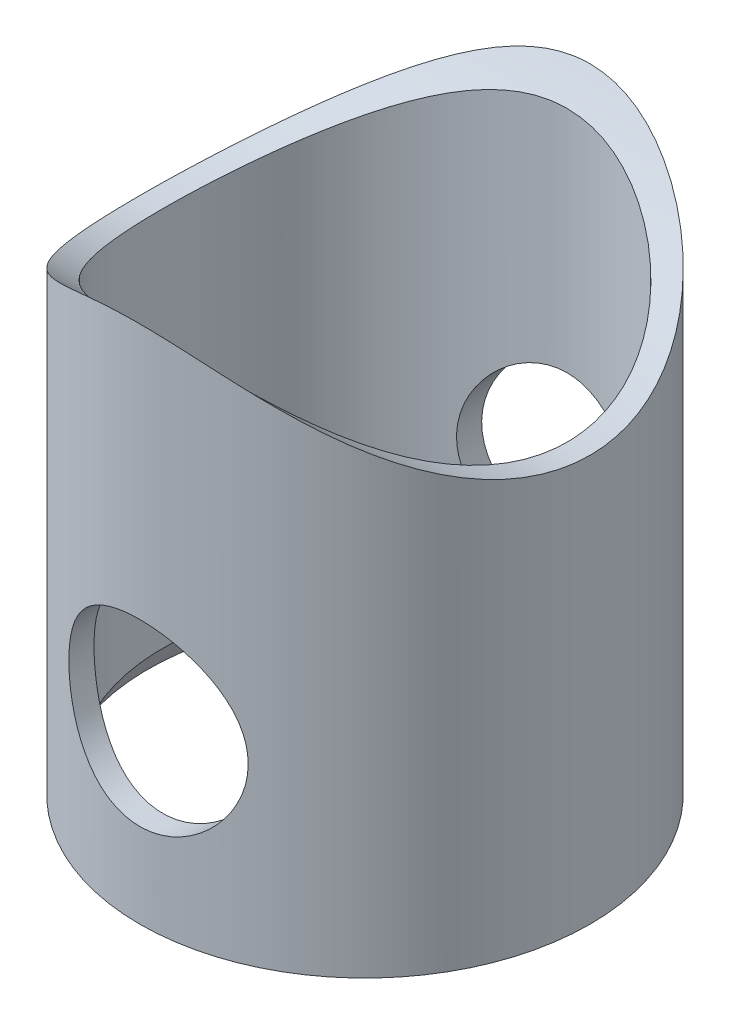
ISO-10303-21;
HEADER;
FILE_DESCRIPTION(('STEP AP214'),'2;1');
FILE_NAME('part.step','',(''),(''),'','','');
FILE_SCHEMA(('AUTOMOTIVE_DESIGN { 1 0 10303 214 1 1 1 1 }'));
ENDSEC;
DATA;
#1=APPLICATION_CONTEXT('core data for automotive mechanical design processes');
#2=APPLICATION_PROTOCOL_DEFINITION('international standard','automotive_design',2000,#1);
#3=PRODUCT_CONTEXT('',#1,'mechanical');
#4=PRODUCT('Part','Part','',(#3));
#5=PRODUCT_RELATED_PRODUCT_CATEGORY('part','',(#4));
#6=PRODUCT_DEFINITION_FORMATION('','',#4);
#7=PRODUCT_DEFINITION_CONTEXT('part definition',#1,'design');
#8=PRODUCT_DEFINITION('design','',#6,#7);
#9=PRODUCT_DEFINITION_SHAPE('','',#8);
#10=(LENGTH_UNIT() NAMED_UNIT(*) SI_UNIT(.MILLI.,.METRE.));
#11=(NAMED_UNIT(*) PLANE_ANGLE_UNIT() SI_UNIT($,.RADIAN.));
#12=(NAMED_UNIT(*) SI_UNIT($,.STERADIAN.) SOLID_ANGLE_UNIT());
#13=UNCERTAINTY_MEASURE_WITH_UNIT(LENGTH_MEASURE(1.E-05),#10,'distance_accuracy_value','');
#14=(GEOMETRIC_REPRESENTATION_CONTEXT(3) GLOBAL_UNCERTAINTY_ASSIGNED_CONTEXT((#13)) GLOBAL_UNIT_ASSIGNED_CONTEXT((#10,
#11,#12)) REPRESENTATION_CONTEXT('',''));
#15=CARTESIAN_POINT('',(0.,0.,0.));
#16=DIRECTION('',(0.,0.,1.));
#17=DIRECTION('',(1.,0.,0.));
#18=AXIS2_PLACEMENT_3D('',#15,#16,#17);
#19=CARTESIAN_POINT('',(0.,134.5,0.));
#20=DIRECTION('',(0.,1.,0.));
#21=DIRECTION('',(0.,0.,1.));
#22=AXIS2_PLACEMENT_3D('',#19,#20,#21);
#23=PLANE('',#22);
#24=CARTESIAN_POINT('',(0.,134.5,0.));
#25=DIRECTION('',(0.,1.,0.));
#26=DIRECTION('',(0.,0.,1.));
#27=AXIS2_PLACEMENT_3D('',#24,#25,#26);
#28=CIRCLE('',#27,12.8160254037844);
#29=CARTESIAN_POINT('',(0.,134.5,12.8160254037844));
#30=VERTEX_POINT('',#29);
#31=EDGE_CURVE('E41',#30,#30,#28,.T.);
#32=ORIENTED_EDGE('',*,*,#31,.T.);
#33=EDGE_LOOP('',(#32));
#34=FACE_BOUND('',#33,.T.);
#35=CARTESIAN_POINT('',(0.,134.5,0.));
#36=DIRECTION('',(0.,1.,0.));
#37=DIRECTION('',(0.,0.,1.));
#38=AXIS2_PLACEMENT_3D('',#35,#36,#37);
#39=CIRCLE('',#38,13.3);
#40=CARTESIAN_POINT('',(0.,134.5,13.3));
#41=VERTEX_POINT('',#40);
#42=EDGE_CURVE('E46',#41,#41,#39,.T.);
#43=ORIENTED_EDGE('',*,*,#42,.F.);
#44=EDGE_LOOP('',(#43));
#45=FACE_BOUND('',#44,.T.);
#46=ADVANCED_FACE('F29',(#34,#45),#23,.F.);
#47=CARTESIAN_POINT('',(0.,174.5,0.));
#48=DIRECTION('',(0.,-1.,0.));
#49=DIRECTION('',(0.,0.,-1.));
#50=AXIS2_PLACEMENT_3D('',#47,#48,#49);
#51=CYLINDRICAL_SURFACE('',#50,13.3);
#52=CARTESIAN_POINT('',(0.,150.1,-13.3));
#53=CARTESIAN_POINT('',(-0.142536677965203,150.099999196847,-13.2999993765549));
#54=CARTESIAN_POINT('',(-0.285128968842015,150.09424201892,-13.2977022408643));
#55=CARTESIAN_POINT('',(-0.569305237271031,150.071265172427,-13.2885713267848));
#56=CARTESIAN_POINT('',(-0.710888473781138,150.054037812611,-13.2817345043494));
#57=CARTESIAN_POINT('',(-0.992246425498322,150.008243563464,-13.2636856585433));
#58=CARTESIAN_POINT('',(-1.13201657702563,149.979652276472,-13.2524642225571));
#59=CARTESIAN_POINT('',(-1.40848488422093,149.911404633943,-13.2259392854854));
#60=CARTESIAN_POINT('',(-1.54518175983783,149.871743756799,-13.2106341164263));
#61=CARTESIAN_POINT('',(-1.8140372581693,149.781894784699,-13.1764014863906));
#62=CARTESIAN_POINT('',(-1.94621079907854,149.731746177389,-13.1574876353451));
#63=CARTESIAN_POINT('',(-2.20573880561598,149.621269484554,-13.1164788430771));
#64=CARTESIAN_POINT('',(-2.33309144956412,149.560937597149,-13.09438271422));
#65=CARTESIAN_POINT('',(-2.70656839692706,149.365443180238,-13.0241474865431));
#66=CARTESIAN_POINT('',(-2.94448609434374,149.215655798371,-12.9720116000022));
#67=CARTESIAN_POINT('',(-3.40234346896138,148.87421529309,-12.8597105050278));
#68=CARTESIAN_POINT('',(-3.62108279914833,148.68104844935,-12.7992976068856));
#69=CARTESIAN_POINT('',(-4.02418518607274,148.261286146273,-12.6783372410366));
#70=CARTESIAN_POINT('',(-4.20853153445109,148.034674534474,-12.6177897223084));
#71=CARTESIAN_POINT('',(-4.45929317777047,147.668444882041,-12.5304844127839));
#72=CARTESIAN_POINT('',(-4.53999700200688,147.53893718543,-12.5013936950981));
#73=CARTESIAN_POINT('',(-4.6901374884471,147.273031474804,-12.4458429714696));
#74=CARTESIAN_POINT('',(-4.75957878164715,147.136636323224,-12.4193818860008));
#75=CARTESIAN_POINT('',(-4.88660241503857,146.857813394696,-12.3699542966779));
#76=CARTESIAN_POINT('',(-4.94418392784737,146.715385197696,-12.3469880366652));
#77=CARTESIAN_POINT('',(-5.04689566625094,146.42556503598,-12.3053613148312));
#78=CARTESIAN_POINT('',(-5.09203211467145,146.278175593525,-12.2866987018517));
#79=CARTESIAN_POINT('',(-5.16765870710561,145.986180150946,-12.2550768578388));
#80=CARTESIAN_POINT('',(-5.19871288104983,145.84174376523,-12.2419001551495));
#81=CARTESIAN_POINT('',(-5.24867600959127,145.550479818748,-12.2205622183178));
#82=CARTESIAN_POINT('',(-5.26759043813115,145.403653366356,-12.2123987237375));
#83=CARTESIAN_POINT('',(-5.2930674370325,145.108763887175,-12.2013782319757));
#84=CARTESIAN_POINT('',(-5.29963256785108,144.960701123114,-12.1985201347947));
#85=CARTESIAN_POINT('',(-5.3003373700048,144.664544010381,-12.1982140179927));
#86=CARTESIAN_POINT('',(-5.29447761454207,144.51644966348,-12.2007657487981));
#87=CARTESIAN_POINT('',(-5.27124208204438,144.231686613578,-12.2108210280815));
#88=CARTESIAN_POINT('',(-5.25469206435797,144.094937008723,-12.2179693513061));
#89=CARTESIAN_POINT('',(-5.21106020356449,143.823388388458,-12.2366422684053));
#90=CARTESIAN_POINT('',(-5.18397489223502,143.688590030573,-12.2481683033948));
#91=CARTESIAN_POINT('',(-5.11953959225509,143.421914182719,-12.2752407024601));
#92=CARTESIAN_POINT('',(-5.08219208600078,143.290035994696,-12.2907860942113));
#93=CARTESIAN_POINT('',(-4.99757073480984,143.029966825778,-12.3254358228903));
#94=CARTESIAN_POINT('',(-4.95029307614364,142.901777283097,-12.3445415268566));
#95=CARTESIAN_POINT('',(-4.79203442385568,142.518870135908,-12.4072362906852));
#96=CARTESIAN_POINT('',(-4.66588844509,142.271014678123,-12.45564491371));
#97=CARTESIAN_POINT('',(-4.37743121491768,141.799214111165,-12.5599176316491));
#98=CARTESIAN_POINT('',(-4.21510644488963,141.575277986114,-12.6157845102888));
#99=CARTESIAN_POINT('',(-3.84426486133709,141.139449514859,-12.7339046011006));
#100=CARTESIAN_POINT('',(-3.63316066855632,140.929796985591,-12.7963190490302));
#101=CARTESIAN_POINT('',(-3.17796246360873,140.548097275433,-12.9168799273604));
#102=CARTESIAN_POINT('',(-2.9338619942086,140.376057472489,-12.9750255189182));
#103=CARTESIAN_POINT('',(-2.5450965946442,140.148579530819,-13.0549063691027));
#104=CARTESIAN_POINT('',(-2.41026966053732,140.077295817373,-13.0805288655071));
#105=CARTESIAN_POINT('',(-2.13448955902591,139.946422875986,-13.128346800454));
#106=CARTESIAN_POINT('',(-1.99353888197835,139.886828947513,-13.1505436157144));
#107=CARTESIAN_POINT('',(-1.70652720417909,139.779918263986,-13.1908593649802));
#108=CARTESIAN_POINT('',(-1.56046720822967,139.732599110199,-13.2089790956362));
#109=CARTESIAN_POINT('',(-1.26432439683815,139.650720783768,-13.240606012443));
#110=CARTESIAN_POINT('',(-1.1142418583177,139.616160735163,-13.2541135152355));
#111=CARTESIAN_POINT('',(-0.820203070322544,139.561843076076,-13.2754549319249));
#112=CARTESIAN_POINT('',(-0.676406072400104,139.541334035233,-13.2835759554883));
#113=CARTESIAN_POINT('',(-0.387429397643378,139.512185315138,-13.2951421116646));
#114=CARTESIAN_POINT('',(-0.242249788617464,139.503545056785,-13.2985874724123));
#115=CARTESIAN_POINT('',(0.0483305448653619,139.498228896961,-13.3007056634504));
#116=CARTESIAN_POINT('',(0.193731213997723,139.501550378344,-13.2993795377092));
#117=CARTESIAN_POINT('',(0.483646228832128,139.520115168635,-13.2919942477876));
#118=CARTESIAN_POINT('',(0.628160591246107,139.535358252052,-13.2859351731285));
#119=CARTESIAN_POINT('',(0.908757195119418,139.576652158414,-13.2696277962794));
#120=CARTESIAN_POINT('',(1.04492723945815,139.602188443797,-13.2595792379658));
#121=CARTESIAN_POINT('',(1.31456775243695,139.663752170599,-13.2355671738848));
#122=CARTESIAN_POINT('',(1.44803732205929,139.699783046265,-13.2216023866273));
#123=CARTESIAN_POINT('',(1.71133382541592,139.781997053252,-13.1901066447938));
#124=CARTESIAN_POINT('',(1.84116175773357,139.828177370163,-13.1725766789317));
#125=CARTESIAN_POINT('',(2.09647875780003,139.930329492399,-13.134361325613));
#126=CARTESIAN_POINT('',(2.22196615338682,139.986305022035,-13.1136747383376));
#127=CARTESIAN_POINT('',(2.47155355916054,140.109438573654,-13.0689700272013));
#128=CARTESIAN_POINT('',(2.59549766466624,140.176882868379,-13.0448702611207));
#129=CARTESIAN_POINT('',(2.83732400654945,140.321224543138,-12.9944163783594));
#130=CARTESIAN_POINT('',(2.9552041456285,140.398125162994,-12.9680614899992));
#131=CARTESIAN_POINT('',(3.18425459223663,140.560865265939,-12.9137283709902));
#132=CARTESIAN_POINT('',(3.29542377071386,140.64670624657,-12.8857498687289));
#133=CARTESIAN_POINT('',(3.51046482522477,140.82680124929,-12.8288351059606));
#134=CARTESIAN_POINT('',(3.61433638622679,140.921055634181,-12.7998988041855));
#135=CARTESIAN_POINT('',(3.82082934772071,141.123919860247,-12.7398419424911));
#136=CARTESIAN_POINT('',(3.92291907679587,141.233066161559,-12.7087029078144));
#137=CARTESIAN_POINT('',(4.11755907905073,141.459639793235,-12.6469810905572));
#138=CARTESIAN_POINT('',(4.21011231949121,141.57706452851,-12.6163981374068));
#139=CARTESIAN_POINT('',(4.38517213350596,141.819623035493,-12.5566248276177));
#140=CARTESIAN_POINT('',(4.46767298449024,141.944761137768,-12.5274352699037));
#141=CARTESIAN_POINT('',(4.62194416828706,142.201904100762,-12.4713419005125));
#142=CARTESIAN_POINT('',(4.69371901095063,142.333906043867,-12.4444371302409));
#143=CARTESIAN_POINT('',(4.82665297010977,142.605351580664,-12.3934878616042));
#144=CARTESIAN_POINT('',(4.88770065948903,142.744855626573,-12.3694741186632));
#145=CARTESIAN_POINT('',(4.99771082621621,143.029096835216,-12.3254370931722));
#146=CARTESIAN_POINT('',(5.04667854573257,143.173831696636,-12.3054120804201));
#147=CARTESIAN_POINT('',(5.13203014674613,143.467471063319,-12.2700612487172));
#148=CARTESIAN_POINT('',(5.16841890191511,143.616373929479,-12.2547336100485));
#149=CARTESIAN_POINT('',(5.22821033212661,143.917203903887,-12.2293449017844));
#150=CARTESIAN_POINT('',(5.25161408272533,144.069130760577,-12.2192833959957));
#151=CARTESIAN_POINT('',(5.28394160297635,144.363741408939,-12.2053367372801));
#152=CARTESIAN_POINT('',(5.29378352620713,144.506306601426,-12.2010603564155));
#153=CARTESIAN_POINT('',(5.3019188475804,144.791880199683,-12.1975275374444));
#154=CARTESIAN_POINT('',(5.30020836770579,144.934888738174,-12.1982727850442));
#155=CARTESIAN_POINT('',(5.28525207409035,145.22011327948,-12.2047603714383));
#156=CARTESIAN_POINT('',(5.27201201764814,145.362329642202,-12.2105002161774));
#157=CARTESIAN_POINT('',(5.23414771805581,145.64501097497,-12.2267788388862));
#158=CARTESIAN_POINT('',(5.20951918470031,145.785475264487,-12.2373194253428));
#159=CARTESIAN_POINT('',(5.15032770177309,146.058094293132,-12.2623453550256));
#160=CARTESIAN_POINT('',(5.11619468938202,146.190358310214,-12.276658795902));
#161=CARTESIAN_POINT('',(5.0379817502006,146.451466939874,-12.3089610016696));
#162=CARTESIAN_POINT('',(4.99389836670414,146.580310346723,-12.3269510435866));
#163=CARTESIAN_POINT('',(4.84725268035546,146.960507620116,-12.3856890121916));
#164=CARTESIAN_POINT('',(4.73025205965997,147.205723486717,-12.4312238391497));
#165=CARTESIAN_POINT('',(4.45355725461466,147.687470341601,-12.5331048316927));
#166=CARTESIAN_POINT('',(4.29181017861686,147.922710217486,-12.5899192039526));
#167=CARTESIAN_POINT('',(3.93303667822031,148.363985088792,-12.7065606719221));
#168=CARTESIAN_POINT('',(3.73599976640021,148.570011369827,-12.7663886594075));
#169=CARTESIAN_POINT('',(3.41061794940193,148.85963769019,-12.8557960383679));
#170=CARTESIAN_POINT('',(3.29320611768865,148.955454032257,-12.886444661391));
#171=CARTESIAN_POINT('',(3.05034975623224,149.136854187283,-12.9460793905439));
#172=CARTESIAN_POINT('',(2.92490815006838,149.222441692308,-12.9750660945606));
#173=CARTESIAN_POINT('',(2.66662692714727,149.38281985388,-13.0306012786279));
#174=CARTESIAN_POINT('',(2.53378048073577,149.457600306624,-13.0571474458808));
#175=CARTESIAN_POINT('',(2.26170753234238,149.5956157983,-13.1070130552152));
#176=CARTESIAN_POINT('',(2.12248398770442,149.658856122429,-13.1303339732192));
#177=CARTESIAN_POINT('',(1.84116848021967,149.772189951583,-13.1726975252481));
#178=CARTESIAN_POINT('',(1.69917551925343,149.822502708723,-13.1918105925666));
#179=CARTESIAN_POINT('',(1.41100807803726,149.910944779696,-13.2257358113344));
#180=CARTESIAN_POINT('',(1.26483559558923,149.949079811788,-13.2405499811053));
#181=CARTESIAN_POINT('',(0.969762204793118,150.012704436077,-13.2654224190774));
#182=CARTESIAN_POINT('',(0.820869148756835,150.038225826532,-13.2754926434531));
#183=CARTESIAN_POINT('',(0.521271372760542,150.076461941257,-13.2906259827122));
#184=CARTESIAN_POINT('',(0.370568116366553,150.089186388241,-13.2956928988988));
#185=CARTESIAN_POINT('',(0.183039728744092,150.096965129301,-13.2987909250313));
#186=CARTESIAN_POINT('',(0.146443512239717,150.098102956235,-13.2992441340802));
#187=CARTESIAN_POINT('',(0.0732327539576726,150.099620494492,-13.2998487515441));
#188=CARTESIAN_POINT('',(0.0366182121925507,150.100000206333,-13.3000001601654));
#189=CARTESIAN_POINT('',(0.,150.1,-13.3));
#190=B_SPLINE_CURVE_WITH_KNOTS('',3,(#52,#53,#54,#55,#56,#57,#58,#59,#60,#61,#62,#63,#64,#65,
#66,#67,#68,#69,#70,#71,#72,#73,#74,#75,#76,#77,#78,#79,#80,#81,#82,#83,#84,#85,#86,#87,#88,#89,
#90,#91,#92,#93,#94,#95,#96,#97,#98,#99,#100,#101,#102,#103,#104,#105,#106,#107,#108,#109,#110,
#111,#112,#113,#114,#115,#116,#117,#118,#119,#120,#121,#122,#123,#124,#125,#126,#127,#128,#129,
#130,#131,#132,#133,#134,#135,#136,#137,#138,#139,#140,#141,#142,#143,#144,#145,#146,#147,#148,
#149,#150,#151,#152,#153,#154,#155,#156,#157,#158,#159,#160,#161,#162,#163,#164,#165,#166,#167,
#168,#169,#170,#171,#172,#173,#174,#175,#176,#177,#178,#179,#180,#181,#182,#183,#184,#185,#186,
#187,#188,#189),.UNSPECIFIED.,.T.,.F.,(4,2,2,2,2,2,2,2,2,2,2,2,2,2,2,2,2,2,2,2,2,2,2,2,2,2,2,2,
2,2,2,2,2,2,2,2,2,2,2,2,2,2,2,2,2,2,2,2,2,2,2,2,2,2,2,2,2,2,2,2,2,2,2,2,2,2,2,2,4),(0.,
0.427572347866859,0.855431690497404,1.28421462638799,1.71317296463,2.14054439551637,
2.56807573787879,3.42195789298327,4.31227612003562,5.20302575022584,5.66857385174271,
6.13393003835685,6.59931867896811,7.06447419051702,7.50885798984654,7.95304127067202,
8.3971324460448,8.8412031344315,9.2545156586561,9.66796436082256,10.0813131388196,
10.4948209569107,11.3377903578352,12.1810752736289,13.0890159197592,13.9971345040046,
14.4605812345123,14.9238412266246,15.3870106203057,15.850148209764,16.2860301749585,
16.7218908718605,17.1576562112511,17.5934133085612,18.0096571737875,18.4260374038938,
18.8423023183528,19.2587258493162,19.6877047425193,20.1168310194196,20.5460292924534,
20.9752460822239,21.4326962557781,21.8900036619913,22.3475701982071,22.8049438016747,
23.2668186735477,23.7284927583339,24.189987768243,24.6514445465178,25.0798042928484,
25.5083078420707,25.9365975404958,26.3650487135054,26.7766084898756,27.1883114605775,
28.0111228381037,28.8808202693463,29.7507765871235,30.2141568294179,30.6773693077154,
31.1410163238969,31.6044504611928,32.0594104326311,32.5141564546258,32.9677501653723,
33.4209989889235,33.530844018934,33.6406889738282),.UNSPECIFIED.);
#191=CARTESIAN_POINT('',(0.,150.1,-13.3));
#192=VERTEX_POINT('',#191);
#193=EDGE_CURVE('E73',#192,#192,#190,.T.);
#194=ORIENTED_EDGE('',*,*,#193,.T.);
#195=EDGE_LOOP('',(#194));
#196=FACE_BOUND('',#195,.T.);
#197=CARTESIAN_POINT('',(5.3,144.8,12.1983605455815));
#198=CARTESIAN_POINT('',(5.29999890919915,144.657939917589,12.1983616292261));
#199=CARTESIAN_POINT('',(5.29428056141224,144.515835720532,12.2008504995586));
#200=CARTESIAN_POINT('',(5.27146265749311,144.23265370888,12.2107260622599));
#201=CARTESIAN_POINT('',(5.2543560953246,144.091576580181,12.218115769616));
#202=CARTESIAN_POINT('',(5.20889848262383,143.811277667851,12.2375646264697));
#203=CARTESIAN_POINT('',(5.18052490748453,143.67206018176,12.2496331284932));
#204=CARTESIAN_POINT('',(5.11281667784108,143.396711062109,12.2780475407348));
#205=CARTESIAN_POINT('',(5.07347747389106,143.260580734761,12.2943952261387));
#206=CARTESIAN_POINT('',(4.98440090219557,142.992916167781,12.3307765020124));
#207=CARTESIAN_POINT('',(4.93470788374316,142.861365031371,12.3507943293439));
#208=CARTESIAN_POINT('',(4.82525237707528,142.603036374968,12.3939662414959));
#209=CARTESIAN_POINT('',(4.76548610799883,142.476260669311,12.4171215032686));
#210=CARTESIAN_POINT('',(4.57181455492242,142.104359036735,12.4902985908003));
#211=CARTESIAN_POINT('',(4.42342399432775,141.867323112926,12.5440799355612));
#212=CARTESIAN_POINT('',(4.08350668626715,141.408726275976,12.6589398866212));
#213=CARTESIAN_POINT('',(3.89015302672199,141.188589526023,12.7202515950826));
#214=CARTESIAN_POINT('',(3.46940198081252,140.782717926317,12.8413788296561));
#215=CARTESIAN_POINT('',(3.24199279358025,140.596995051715,12.9011938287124));
#216=CARTESIAN_POINT('',(2.87475139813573,140.344766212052,12.9862439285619));
#217=CARTESIAN_POINT('',(2.74525824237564,140.263818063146,13.0142993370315));
#218=CARTESIAN_POINT('',(2.47934005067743,140.113190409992,13.0675635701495));
#219=CARTESIAN_POINT('',(2.3429178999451,140.043506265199,13.0927735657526));
#220=CARTESIAN_POINT('',(2.06402722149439,139.916014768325,13.1396269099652));
#221=CARTESIAN_POINT('',(1.92155796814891,139.858208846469,13.1612698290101));
#222=CARTESIAN_POINT('',(1.63167907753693,139.755074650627,13.2003406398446));
#223=CARTESIAN_POINT('',(1.48427188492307,139.709740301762,13.2177705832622));
#224=CARTESIAN_POINT('',(1.19273686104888,139.633862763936,13.2471812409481));
#225=CARTESIAN_POINT('',(1.04878784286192,139.602717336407,13.2593821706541));
#226=CARTESIAN_POINT('',(0.758544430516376,139.55249688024,13.2791473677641));
#227=CARTESIAN_POINT('',(0.612251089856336,139.533416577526,13.2867136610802));
#228=CARTESIAN_POINT('',(0.318429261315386,139.507519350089,13.297000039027));
#229=CARTESIAN_POINT('',(0.170900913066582,139.500701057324,13.2997206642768));
#230=CARTESIAN_POINT('',(-0.124216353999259,139.499401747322,13.3002383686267));
#231=CARTESIAN_POINT('',(-0.271805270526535,139.504920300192,13.2980356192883));
#232=CARTESIAN_POINT('',(-0.557610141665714,139.527575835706,13.2890314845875));
#233=CARTESIAN_POINT('',(-0.695888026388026,139.544044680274,13.2824946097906));
#234=CARTESIAN_POINT('',(-0.970512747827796,139.587760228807,13.2652568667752));
#235=CARTESIAN_POINT('',(-1.10685892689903,139.615010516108,13.2545546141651));
#236=CARTESIAN_POINT('',(-1.37660231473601,139.680018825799,13.2292596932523));
#237=CARTESIAN_POINT('',(-1.5100004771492,139.717773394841,13.2146683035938));
#238=CARTESIAN_POINT('',(-1.77308673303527,139.803469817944,13.1819477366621));
#239=CARTESIAN_POINT('',(-1.90277339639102,139.851415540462,13.1638172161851));
#240=CARTESIAN_POINT('',(-2.15947832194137,139.957868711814,13.1241670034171));
#241=CARTESIAN_POINT('',(-2.28642974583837,140.016520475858,13.102601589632));
#242=CARTESIAN_POINT('',(-2.53494661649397,140.143440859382,13.0568007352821));
#243=CARTESIAN_POINT('',(-2.65651006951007,140.211713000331,13.0325643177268));
#244=CARTESIAN_POINT('',(-3.0120732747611,140.430252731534,12.9566962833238));
#245=CARTESIAN_POINT('',(-3.23711464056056,140.594314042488,12.9018786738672));
#246=CARTESIAN_POINT('',(-3.67197100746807,140.966725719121,12.7851755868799));
#247=CARTESIAN_POINT('',(-3.87983566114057,141.177266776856,12.7230623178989));
#248=CARTESIAN_POINT('',(-4.25820299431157,141.630654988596,12.6014776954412));
#249=CARTESIAN_POINT('',(-4.42869363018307,141.873512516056,12.5420071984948));
#250=CARTESIAN_POINT('',(-4.65481821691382,142.261107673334,12.4591079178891));
#251=CARTESIAN_POINT('',(-4.72603025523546,142.39624273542,12.4321980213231));
#252=CARTESIAN_POINT('',(-4.85672074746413,142.67265549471,12.3817271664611));
#253=CARTESIAN_POINT('',(-4.91620396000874,142.813930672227,12.3581648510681));
#254=CARTESIAN_POINT('',(-5.02285070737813,143.101616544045,12.315205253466));
#255=CARTESIAN_POINT('',(-5.07001807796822,143.248025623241,12.295806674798));
#256=CARTESIAN_POINT('',(-5.15154922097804,143.544918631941,12.2618715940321));
#257=CARTESIAN_POINT('',(-5.18591401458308,143.695402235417,12.2473347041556));
#258=CARTESIAN_POINT('',(-5.23974204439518,143.989974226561,12.2243979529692));
#259=CARTESIAN_POINT('',(-5.25998361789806,144.133895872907,12.2156789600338));
#260=CARTESIAN_POINT('',(-5.28858043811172,144.423129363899,12.2033258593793));
#261=CARTESIAN_POINT('',(-5.29693638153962,144.568441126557,12.1996914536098));
#262=CARTESIAN_POINT('',(-5.3016631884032,144.85925925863,12.1976380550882));
#263=CARTESIAN_POINT('',(-5.29803708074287,145.004765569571,12.1992177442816));
#264=CARTESIAN_POINT('',(-5.2788508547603,145.294835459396,12.207532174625));
#265=CARTESIAN_POINT('',(-5.26329103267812,145.439399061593,12.2142667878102));
#266=CARTESIAN_POINT('',(-5.22163024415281,145.71832166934,12.2321322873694));
#267=CARTESIAN_POINT('',(-5.19617614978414,145.852794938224,12.2429926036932));
#268=CARTESIAN_POINT('',(-5.13506249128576,146.119020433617,12.2687496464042));
#269=CARTESIAN_POINT('',(-5.09939962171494,146.250771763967,12.2836476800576));
#270=CARTESIAN_POINT('',(-4.97755822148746,146.640626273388,12.3337638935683));
#271=CARTESIAN_POINT('',(-4.87649410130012,146.893546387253,12.3744191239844));
#272=CARTESIAN_POINT('',(-4.63308278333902,147.389195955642,12.467641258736));
#273=CARTESIAN_POINT('',(-4.48923335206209,147.631101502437,12.5206228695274));
#274=CARTESIAN_POINT('',(-4.16588487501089,148.088451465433,12.6318904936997));
#275=CARTESIAN_POINT('',(-3.98637139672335,148.303885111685,12.6901786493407));
#276=CARTESIAN_POINT('',(-3.58110737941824,148.718625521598,12.8106734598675));
#277=CARTESIAN_POINT('',(-3.35293402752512,148.915597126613,12.8728545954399));
#278=CARTESIAN_POINT('',(-2.98749177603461,149.180367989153,12.960737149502));
#279=CARTESIAN_POINT('',(-2.86173352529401,149.263550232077,12.989148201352));
#280=CARTESIAN_POINT('',(-2.60319640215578,149.419100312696,13.0434187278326));
#281=CARTESIAN_POINT('',(-2.47042057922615,149.491472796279,13.0692792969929));
#282=CARTESIAN_POINT('',(-2.1986825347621,149.624801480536,13.1177303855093));
#283=CARTESIAN_POINT('',(-2.05972010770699,149.685757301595,13.1403207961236));
#284=CARTESIAN_POINT('',(-1.77662203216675,149.795663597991,13.1815803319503));
#285=CARTESIAN_POINT('',(-1.6324886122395,149.844619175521,13.2002511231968));
#286=CARTESIAN_POINT('',(-1.34010182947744,149.930040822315,13.2331312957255));
#287=CARTESIAN_POINT('',(-1.19184940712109,149.966509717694,13.2473416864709));
#288=CARTESIAN_POINT('',(-0.892378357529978,150.026564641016,13.270878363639));
#289=CARTESIAN_POINT('',(-0.741159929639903,150.050151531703,13.2802049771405));
#290=CARTESIAN_POINT('',(-0.446922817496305,150.08306060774,13.2932508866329));
#291=CARTESIAN_POINT('',(-0.304010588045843,150.093210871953,13.2972954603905));
#292=CARTESIAN_POINT('',(-0.0177257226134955,150.101905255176,13.3007587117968));
#293=CARTESIAN_POINT('',(0.12564705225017,150.100445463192,13.300175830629));
#294=CARTESIAN_POINT('',(0.411634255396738,150.085929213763,13.2943974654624));
#295=CARTESIAN_POINT('',(0.554249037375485,150.072878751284,13.289204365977));
#296=CARTESIAN_POINT('',(0.837778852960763,150.035320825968,13.2743469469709));
#297=CARTESIAN_POINT('',(0.978693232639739,150.010809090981,13.264680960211));
#298=CARTESIAN_POINT('',(1.25344769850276,149.951505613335,13.2414987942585));
#299=CARTESIAN_POINT('',(1.38737206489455,149.917053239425,13.2281101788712));
#300=CARTESIAN_POINT('',(1.65178774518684,149.837921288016,13.197701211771));
#301=CARTESIAN_POINT('',(1.78227783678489,149.793238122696,13.1806795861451));
#302=CARTESIAN_POINT('',(2.03895751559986,149.69403452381,13.1434188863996));
#303=CARTESIAN_POINT('',(2.16514806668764,149.639516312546,13.1231805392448));
#304=CARTESIAN_POINT('',(2.41255717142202,149.521059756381,13.0799607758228));
#305=CARTESIAN_POINT('',(2.5337739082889,149.457118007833,13.0569783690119));
#306=CARTESIAN_POINT('',(2.89929405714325,149.245835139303,12.9825842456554));
#307=CARTESIAN_POINT('',(3.1342858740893,149.083343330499,12.9274069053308));
#308=CARTESIAN_POINT('',(3.57461093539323,148.723404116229,12.812653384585));
#309=CARTESIAN_POINT('',(3.77993197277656,148.525942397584,12.753075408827));
#310=CARTESIAN_POINT('',(4.06809972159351,148.200491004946,12.6629999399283));
#311=CARTESIAN_POINT('',(4.16324085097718,148.083325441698,12.6319621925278));
#312=CARTESIAN_POINT('',(4.34331895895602,147.841106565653,12.5711812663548));
#313=CARTESIAN_POINT('',(4.42825958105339,147.71605609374,12.541437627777));
#314=CARTESIAN_POINT('',(4.58738801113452,147.458717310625,12.4841112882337));
#315=CARTESIAN_POINT('',(4.66156928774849,147.32642466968,12.4565299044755));
#316=CARTESIAN_POINT('',(4.79849551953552,147.055538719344,12.4044269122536));
#317=CARTESIAN_POINT('',(4.86124604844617,146.916948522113,12.3799038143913));
#318=CARTESIAN_POINT('',(4.96971882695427,146.646927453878,12.336733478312));
#319=CARTESIAN_POINT('',(5.01645968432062,146.515957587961,12.3177575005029));
#320=CARTESIAN_POINT('',(5.09959209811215,146.250348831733,12.2835736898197));
#321=CARTESIAN_POINT('',(5.13598834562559,146.11571163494,12.2683641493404));
#322=CARTESIAN_POINT('',(5.19804424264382,145.843900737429,12.2422003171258));
#323=CARTESIAN_POINT('',(5.22372772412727,145.706733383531,12.2312365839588));
#324=CARTESIAN_POINT('',(5.2642031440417,145.430571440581,12.2138714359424));
#325=CARTESIAN_POINT('',(5.27900144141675,145.291577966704,12.2074673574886));
#326=CARTESIAN_POINT('',(5.29218836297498,145.093590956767,12.2017521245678));
#327=CARTESIAN_POINT('',(5.29511674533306,145.034922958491,12.2004812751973));
#328=CARTESIAN_POINT('',(5.29902285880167,144.917505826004,12.1987852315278));
#329=CARTESIAN_POINT('',(5.30000045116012,144.858756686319,12.1983600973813));
#330=CARTESIAN_POINT('',(5.3,144.8,12.1983605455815));
#331=B_SPLINE_CURVE_WITH_KNOTS('',3,(#197,#198,#199,#200,#201,#202,#203,#204,#205,#206,#207,
#208,#209,#210,#211,#212,#213,#214,#215,#216,#217,#218,#219,#220,#221,#222,#223,#224,#225,#226,
#227,#228,#229,#230,#231,#232,#233,#234,#235,#236,#237,#238,#239,#240,#241,#242,#243,#244,#245,
#246,#247,#248,#249,#250,#251,#252,#253,#254,#255,#256,#257,#258,#259,#260,#261,#262,#263,#264,
#265,#266,#267,#268,#269,#270,#271,#272,#273,#274,#275,#276,#277,#278,#279,#280,#281,#282,#283,
#284,#285,#286,#287,#288,#289,#290,#291,#292,#293,#294,#295,#296,#297,#298,#299,#300,#301,#302,
#303,#304,#305,#306,#307,#308,#309,#310,#311,#312,#313,#314,#315,#316,#317,#318,#319,#320,#321,
#322,#323,#324,#325,#326,#327,#328,#329,#330),.UNSPECIFIED.,.T.,.F.,(4,2,2,2,2,2,2,2,2,2,2,2,2,
2,2,2,2,2,2,2,2,2,2,2,2,2,2,2,2,2,2,2,2,2,2,2,2,2,2,2,2,2,2,2,2,2,2,2,2,2,2,2,2,2,2,2,2,2,2,2,2,
2,2,2,2,2,4),(0.,0.426120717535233,0.852503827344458,1.27974367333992,1.70716103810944,
2.13278392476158,2.55856692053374,3.40907392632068,4.30335051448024,5.19793770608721,
5.66325359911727,6.12837730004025,6.5935569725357,7.0585096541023,7.50129079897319,
7.94387825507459,8.38641632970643,8.82893898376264,9.24667314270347,9.66454625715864,
10.0822821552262,10.5001769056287,10.9241881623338,11.3483550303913,12.1961403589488,
13.0992189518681,14.0025881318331,14.4673993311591,14.9320215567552,15.3964989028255,
15.8609391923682,16.2971693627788,16.7333739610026,17.1694683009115,17.6055518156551,
18.0169389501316,18.4284594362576,19.2508500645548,20.106449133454,20.9623951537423,
21.8810022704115,22.3408448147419,22.8004891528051,23.2601487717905,23.7196126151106,
24.1789723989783,24.6383014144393,25.0677523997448,25.4973480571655,25.9267216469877,
26.3562554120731,26.7725780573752,27.1890469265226,27.6054218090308,28.0219474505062,
28.8908828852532,29.7601748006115,30.2219745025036,30.683608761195,31.1455220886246,
31.6072095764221,32.0277960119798,32.4481914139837,32.8676465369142,33.2868564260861,
33.4630893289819,33.639334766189),.UNSPECIFIED.);
#332=CARTESIAN_POINT('',(5.3,144.8,12.1983605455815));
#333=VERTEX_POINT('',#332);
#334=EDGE_CURVE('E69',#333,#333,#331,.T.);
#335=ORIENTED_EDGE('',*,*,#334,.T.);
#336=EDGE_LOOP('',(#335));
#337=FACE_BOUND('',#336,.T.);
#338=CARTESIAN_POINT('',(0.,165.244138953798,-13.3));
#339=CARTESIAN_POINT('',(0.247042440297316,165.244132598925,-13.2999973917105));
#340=CARTESIAN_POINT('',(0.494157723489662,165.234703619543,-13.2930984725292));
#341=CARTESIAN_POINT('',(0.986329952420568,165.197458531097,-13.2656695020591));
#342=CARTESIAN_POINT('',(1.23138549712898,165.169630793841,-13.2451308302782));
#343=CARTESIAN_POINT('',(1.71808065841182,165.096865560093,-13.1908418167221));
#344=CARTESIAN_POINT('',(1.9597099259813,165.051884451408,-13.1570577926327));
#345=CARTESIAN_POINT('',(2.43756439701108,164.946780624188,-13.0769655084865));
#346=CARTESIAN_POINT('',(2.67378763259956,164.886652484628,-13.0306527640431));
#347=CARTESIAN_POINT('',(3.22277568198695,164.729808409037,-12.9076923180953));
#348=CARTESIAN_POINT('',(3.53289348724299,164.62768476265,-12.8261136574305));
#349=CARTESIAN_POINT('',(4.14046120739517,164.405226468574,-12.64307611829));
#350=CARTESIAN_POINT('',(4.43790520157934,164.284883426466,-12.5416080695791));
#351=CARTESIAN_POINT('',(5.02058663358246,164.03060044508,-12.3199472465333));
#352=CARTESIAN_POINT('',(5.30579328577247,163.89662877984,-12.1997104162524));
#353=CARTESIAN_POINT('',(5.86341795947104,163.619459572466,-11.9417211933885));
#354=CARTESIAN_POINT('',(6.1358363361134,163.476262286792,-11.8039692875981));
#355=CARTESIAN_POINT('',(6.76845313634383,163.129019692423,-11.4565643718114));
#356=CARTESIAN_POINT('',(7.12309295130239,162.922360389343,-11.2393650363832));
#357=CARTESIAN_POINT('',(7.80915115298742,162.505185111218,-10.7739964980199));
#358=CARTESIAN_POINT('',(8.14056084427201,162.294667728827,-10.5258157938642));
#359=CARTESIAN_POINT('',(8.77938134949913,161.875910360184,-9.99918253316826));
#360=CARTESIAN_POINT('',(9.0868120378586,161.66766861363,-9.72075551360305));
#361=CARTESIAN_POINT('',(9.67666117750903,161.258570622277,-9.13374190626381));
#362=CARTESIAN_POINT('',(9.95908814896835,161.057711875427,-8.82516566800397));
#363=CARTESIAN_POINT('',(10.4430887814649,160.707253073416,-8.24288254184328));
#364=CARTESIAN_POINT('',(10.6495347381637,160.555436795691,-7.9745483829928));
#365=CARTESIAN_POINT('',(11.0436741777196,160.262184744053,-7.41910897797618));
#366=CARTESIAN_POINT('',(11.2313713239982,160.120746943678,-7.13200741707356));
#367=CARTESIAN_POINT('',(11.5860983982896,159.850929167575,-6.53997399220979));
#368=CARTESIAN_POINT('',(11.7531527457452,159.722533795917,-6.23506383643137));
#369=CARTESIAN_POINT('',(12.0648711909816,159.481168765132,-5.60815092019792));
#370=CARTESIAN_POINT('',(12.2095390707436,159.368196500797,-5.2861510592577));
#371=CARTESIAN_POINT('',(12.4526832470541,159.17722723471,-4.68070260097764));
#372=CARTESIAN_POINT('',(12.5548441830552,159.096532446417,-4.39958086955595));
#373=CARTESIAN_POINT('',(12.7408127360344,158.949070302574,-3.82779666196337));
#374=CARTESIAN_POINT('',(12.8246238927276,158.882300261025,-3.53713603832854));
#375=CARTESIAN_POINT('',(12.9727351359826,158.763952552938,-2.9479443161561));
#376=CARTESIAN_POINT('',(13.0370418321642,158.712369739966,-2.64941592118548));
#377=CARTESIAN_POINT('',(13.1452038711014,158.625412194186,-2.04632788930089));
#378=CARTESIAN_POINT('',(13.1890589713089,158.590037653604,-1.74176818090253));
#379=CARTESIAN_POINT('',(13.2557136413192,158.536161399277,-1.12772701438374));
#380=CARTESIAN_POINT('',(13.2784357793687,158.517721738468,-0.818231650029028));
#381=CARTESIAN_POINT('',(13.3021504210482,158.498351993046,-0.197857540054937));
#382=CARTESIAN_POINT('',(13.3031428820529,158.497421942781,0.113021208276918));
#383=CARTESIAN_POINT('',(13.2833792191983,158.513090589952,0.733644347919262));
#384=CARTESIAN_POINT('',(13.2626226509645,158.529689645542,1.04338871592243));
#385=CARTESIAN_POINT('',(13.199720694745,158.580040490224,1.65927379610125));
#386=CARTESIAN_POINT('',(13.1575758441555,158.613791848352,1.9654145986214));
#387=CARTESIAN_POINT('',(13.0556006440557,158.695308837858,2.55450616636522));
#388=CARTESIAN_POINT('',(12.9969165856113,158.742164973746,2.83778344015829));
#389=CARTESIAN_POINT('',(12.8619710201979,158.84960174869,3.3974336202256));
#390=CARTESIAN_POINT('',(12.7857103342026,158.910181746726,3.67380684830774));
#391=CARTESIAN_POINT('',(12.6165653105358,159.044026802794,4.21823927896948));
#392=CARTESIAN_POINT('',(12.5236812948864,159.117291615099,4.4862986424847));
#393=CARTESIAN_POINT('',(12.3222863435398,159.275375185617,5.01306407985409));
#394=CARTESIAN_POINT('',(12.2137696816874,159.360198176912,5.27176668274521));
#395=CARTESIAN_POINT('',(11.9712949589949,159.548612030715,5.80267841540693));
#396=CARTESIAN_POINT('',(11.8359044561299,159.653217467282,6.07387262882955));
#397=CARTESIAN_POINT('',(11.5489783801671,159.873160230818,6.60316388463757));
#398=CARTESIAN_POINT('',(11.397436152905,159.98850197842,6.86125546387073));
#399=CARTESIAN_POINT('',(11.0794506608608,160.228248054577,7.36370707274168));
#400=CARTESIAN_POINT('',(10.9130054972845,160.352653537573,7.60806534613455));
#401=CARTESIAN_POINT('',(10.5662908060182,160.608887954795,8.08269085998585));
#402=CARTESIAN_POINT('',(10.3860193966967,160.740717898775,8.31295617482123));
#403=CARTESIAN_POINT('',(9.97400382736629,161.037995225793,8.80525245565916));
#404=CARTESIAN_POINT('',(9.73931657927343,161.204764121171,9.06402714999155));
#405=CARTESIAN_POINT('',(9.25237209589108,161.543870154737,9.56057381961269));
#406=CARTESIAN_POINT('',(9.0001120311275,161.716208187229,9.79834239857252));
#407=CARTESIAN_POINT('',(8.47854658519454,162.063656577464,10.2530040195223));
#408=CARTESIAN_POINT('',(8.20922051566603,162.238770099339,10.4698708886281));
#409=CARTESIAN_POINT('',(7.65424871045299,162.588278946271,10.8821862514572));
#410=CARTESIAN_POINT('',(7.36860474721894,162.762674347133,11.0776370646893));
#411=CARTESIAN_POINT('',(6.80405212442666,163.09351603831,11.4322838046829));
#412=CARTESIAN_POINT('',(6.52637097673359,163.250297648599,11.5931207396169));
#413=CARTESIAN_POINT('',(5.95688910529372,163.556633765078,11.8957748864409));
#414=CARTESIAN_POINT('',(5.66508647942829,163.706187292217,12.0375895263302));
#415=CARTESIAN_POINT('',(5.06760548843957,163.993572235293,12.3010489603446));
#416=CARTESIAN_POINT('',(4.76195159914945,164.131423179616,12.4227276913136));
#417=CARTESIAN_POINT('',(4.13622158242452,164.390504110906,12.644831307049));
#418=CARTESIAN_POINT('',(3.8161526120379,164.511742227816,12.7452666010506));
#419=CARTESIAN_POINT('',(3.26587817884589,164.696637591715,12.8948660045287));
#420=CARTESIAN_POINT('',(3.0393756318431,164.766360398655,12.9501875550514));
#421=CARTESIAN_POINT('',(2.58041303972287,164.893093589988,13.0493888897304));
#422=CARTESIAN_POINT('',(2.34795499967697,164.950108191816,13.0932724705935));
#423=CARTESIAN_POINT('',(1.8783727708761,165.049270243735,13.1688324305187));
#424=CARTESIAN_POINT('',(1.64125830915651,165.091445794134,13.200531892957));
#425=CARTESIAN_POINT('',(1.16330404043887,165.159280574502,13.2512058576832));
#426=CARTESIAN_POINT('',(0.922464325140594,165.18494021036,13.2701806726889));
#427=CARTESIAN_POINT('',(0.437251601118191,165.218626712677,13.295044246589));
#428=CARTESIAN_POINT('',(0.192865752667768,165.226535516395,13.3008453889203));
#429=CARTESIAN_POINT('',(-0.295748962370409,165.223965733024,13.2989556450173));
#430=CARTESIAN_POINT('',(-0.539977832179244,165.21348753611,13.2912650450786));
#431=CARTESIAN_POINT('',(-1.02648332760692,165.174657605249,13.2625708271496));
#432=CARTESIAN_POINT('',(-1.26875740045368,165.1462854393,13.2415519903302));
#433=CARTESIAN_POINT('',(-1.74930548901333,165.073009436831,13.1866771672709));
#434=CARTESIAN_POINT('',(-1.98757888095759,165.028103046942,13.1528191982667));
#435=CARTESIAN_POINT('',(-2.51494211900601,164.911202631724,13.0634074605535));
#436=CARTESIAN_POINT('',(-2.80261482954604,164.83530408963,13.0046066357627));
#437=CARTESIAN_POINT('',(-3.36826973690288,164.665131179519,12.8697084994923));
#438=CARTESIAN_POINT('',(-3.6462489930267,164.570851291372,12.7936059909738));
#439=CARTESIAN_POINT('',(-4.19252790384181,164.367662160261,12.6251582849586));
#440=CARTESIAN_POINT('',(-4.46080159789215,164.258716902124,12.5327729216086));
#441=CARTESIAN_POINT('',(-4.98681756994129,164.029948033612,12.3329161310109));
#442=CARTESIAN_POINT('',(-5.24455932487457,163.910123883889,12.2254439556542));
#443=CARTESIAN_POINT('',(-5.87125876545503,163.603094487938,11.9409885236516));
#444=CARTESIAN_POINT('',(-6.23405728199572,163.411209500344,11.7554409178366));
#445=CARTESIAN_POINT('',(-6.93758440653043,163.018292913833,11.3544672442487));
#446=CARTESIAN_POINT('',(-7.2783033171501,162.817257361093,11.1390281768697));
#447=CARTESIAN_POINT('',(-7.93811938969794,162.412192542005,10.678865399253));
#448=CARTESIAN_POINT('',(-8.25719351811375,162.208160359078,10.4341112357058));
#449=CARTESIAN_POINT('',(-8.87279685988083,161.802673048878,9.91591160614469));
#450=CARTESIAN_POINT('',(-9.16932974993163,161.601217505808,9.64247083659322));
#451=CARTESIAN_POINT('',(-9.74371741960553,161.202123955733,9.06198575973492));
#452=CARTESIAN_POINT('',(-10.0211519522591,161.004615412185,8.75443501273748));
#453=CARTESIAN_POINT('',(-10.5494592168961,160.621906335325,8.11002335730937));
#454=CARTESIAN_POINT('',(-10.8003276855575,160.436707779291,7.77315776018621));
#455=CARTESIAN_POINT('',(-11.2719600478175,160.083901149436,7.07184529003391));
#456=CARTESIAN_POINT('',(-11.4928037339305,159.916246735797,6.70747568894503));
#457=CARTESIAN_POINT('',(-11.9016240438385,159.602813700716,5.95193777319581));
#458=CARTESIAN_POINT('',(-12.089618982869,159.457022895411,5.56078456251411));
#459=CARTESIAN_POINT('',(-12.3744938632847,159.234526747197,4.88367674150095));
#460=CARTESIAN_POINT('',(-12.4812643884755,159.150655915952,4.6041897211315));
#461=CARTESIAN_POINT('',(-12.6766240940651,158.996603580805,4.03529215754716));
#462=CARTESIAN_POINT('',(-12.7652180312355,158.926418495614,3.74588423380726));
#463=CARTESIAN_POINT('',(-12.923014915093,158.801065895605,3.1588017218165));
#464=CARTESIAN_POINT('',(-12.9922280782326,158.74589046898,2.86113158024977));
#465=CARTESIAN_POINT('',(-13.1102959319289,158.651616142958,2.25924343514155));
#466=CARTESIAN_POINT('',(-13.1591499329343,158.612517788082,1.95502521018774));
#467=CARTESIAN_POINT('',(-13.2358559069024,158.551116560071,1.34098271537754));
#468=CARTESIAN_POINT('',(-13.2636211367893,158.528883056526,1.03114060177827));
#469=CARTESIAN_POINT('',(-13.2973377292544,158.501979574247,0.409506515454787));
#470=CARTESIAN_POINT('',(-13.3032891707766,158.497309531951,0.097714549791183));
#471=CARTESIAN_POINT('',(-13.2932742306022,158.505641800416,-0.525283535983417));
#472=CARTESIAN_POINT('',(-13.2773073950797,158.518644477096,-0.836489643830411));
#473=CARTESIAN_POINT('',(-13.2237382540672,158.562028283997,-1.45579731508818));
#474=CARTESIAN_POINT('',(-13.1861365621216,158.592408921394,-1.76389896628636));
#475=CARTESIAN_POINT('',(-13.0928570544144,158.667526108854,-2.35615459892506));
#476=CARTESIAN_POINT('',(-13.0384111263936,158.711282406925,-2.64062930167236));
#477=CARTESIAN_POINT('',(-12.9117632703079,158.812719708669,-3.20303810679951));
#478=CARTESIAN_POINT('',(-12.8395622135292,158.870400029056,-3.48097252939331));
#479=CARTESIAN_POINT('',(-12.6783294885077,158.9986833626,-4.02883459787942));
#480=CARTESIAN_POINT('',(-12.5892980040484,159.069286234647,-4.29876233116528));
#481=CARTESIAN_POINT('',(-12.3953897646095,159.222307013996,-4.82951117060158));
#482=CARTESIAN_POINT('',(-12.2905071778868,159.304729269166,-5.09032888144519));
#483=CARTESIAN_POINT('',(-12.0563721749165,159.487655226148,-5.62368227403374));
#484=CARTESIAN_POINT('',(-11.9258033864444,159.589102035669,-5.89531590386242));
#485=CARTESIAN_POINT('',(-11.6485181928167,159.802906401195,-6.42585945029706));
#486=CARTESIAN_POINT('',(-11.5017951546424,159.915268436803,-6.68476407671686));
#487=CARTESIAN_POINT('',(-11.1934531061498,160.149266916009,-7.18915773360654));
#488=CARTESIAN_POINT('',(-11.0318332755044,160.270903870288,-7.43464602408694));
#489=CARTESIAN_POINT('',(-10.694774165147,160.521859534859,-7.91183660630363));
#490=CARTESIAN_POINT('',(-10.5193329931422,160.651179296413,-8.14353700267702));
#491=CARTESIAN_POINT('',(-10.1186909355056,160.942746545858,-8.63845943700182));
#492=CARTESIAN_POINT('',(-9.89061138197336,161.106355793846,-8.8985532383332));
#493=CARTESIAN_POINT('',(-9.4170763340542,161.439632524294,-9.39825509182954));
#494=CARTESIAN_POINT('',(-9.17161821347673,161.609300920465,-9.63786003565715));
#495=CARTESIAN_POINT('',(-8.66388998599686,161.952058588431,-10.0967452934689));
#496=CARTESIAN_POINT('',(-8.40159785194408,162.125152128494,-10.315998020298));
#497=CARTESIAN_POINT('',(-7.86101324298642,162.471449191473,-10.7336452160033));
#498=CARTESIAN_POINT('',(-7.58272211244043,162.644652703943,-10.9320414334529));
#499=CARTESIAN_POINT('',(-7.02048819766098,162.981565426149,-11.300961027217));
#500=CARTESIAN_POINT('',(-6.73710433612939,163.145392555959,-11.4722279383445));
#501=CARTESIAN_POINT('',(-6.15530320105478,163.466292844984,-11.7946117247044));
#502=CARTESIAN_POINT('',(-5.85688328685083,163.623364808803,-11.9457250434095));
#503=CARTESIAN_POINT('',(-5.24514955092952,163.926038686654,-12.2266738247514));
#504=CARTESIAN_POINT('',(-4.93185722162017,164.071656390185,-12.3565388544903));
#505=CARTESIAN_POINT('',(-4.28983338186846,164.34612165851,-12.5938203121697));
#506=CARTESIAN_POINT('',(-3.96111067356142,164.474978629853,-12.7012493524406));
#507=CARTESIAN_POINT('',(-3.39694742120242,164.671567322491,-12.8610599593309));
#508=CARTESIAN_POINT('',(-3.16556467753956,164.745618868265,-12.9200267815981));
#509=CARTESIAN_POINT('',(-2.69637689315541,164.880680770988,-13.0260257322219));
#510=CARTESIAN_POINT('',(-2.45857421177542,164.941695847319,-13.0730621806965));
#511=CARTESIAN_POINT('',(-1.97814073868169,165.048256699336,-13.1543197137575));
#512=CARTESIAN_POINT('',(-1.73552725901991,165.093849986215,-13.188580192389));
#513=CARTESIAN_POINT('',(-1.24627425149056,165.167784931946,-13.2437647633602));
#514=CARTESIAN_POINT('',(-0.999637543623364,165.196138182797,-13.2646978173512));
#515=CARTESIAN_POINT('',(-0.627010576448,165.224797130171,-13.2858025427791));
#516=CARTESIAN_POINT('',(-0.501798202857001,165.232039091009,-13.291121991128));
#517=CARTESIAN_POINT('',(-0.251063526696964,165.241712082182,-13.2982217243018));
#518=CARTESIAN_POINT('',(-0.12554116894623,165.244142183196,-13.3000013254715));
#519=CARTESIAN_POINT('',(0.,165.244138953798,-13.3));
#520=B_SPLINE_CURVE_WITH_KNOTS('',3,(#338,#339,#340,#341,#342,#343,#344,#345,#346,#347,#348,
#349,#350,#351,#352,#353,#354,#355,#356,#357,#358,#359,#360,#361,#362,#363,#364,#365,#366,#367,
#368,#369,#370,#371,#372,#373,#374,#375,#376,#377,#378,#379,#380,#381,#382,#383,#384,#385,#386,
#387,#388,#389,#390,#391,#392,#393,#394,#395,#396,#397,#398,#399,#400,#401,#402,#403,#404,#405,
#406,#407,#408,#409,#410,#411,#412,#413,#414,#415,#416,#417,#418,#419,#420,#421,#422,#423,#424,
#425,#426,#427,#428,#429,#430,#431,#432,#433,#434,#435,#436,#437,#438,#439,#440,#441,#442,#443,
#444,#445,#446,#447,#448,#449,#450,#451,#452,#453,#454,#455,#456,#457,#458,#459,#460,#461,#462,
#463,#464,#465,#466,#467,#468,#469,#470,#471,#472,#473,#474,#475,#476,#477,#478,#479,#480,#481,
#482,#483,#484,#485,#486,#487,#488,#489,#490,#491,#492,#493,#494,#495,#496,#497,#498,#499,#500,
#501,#502,#503,#504,#505,#506,#507,#508,#509,#510,#511,#512,#513,#514,#515,#516,#517,#518,#519),
.UNSPECIFIED.,.T.,.F.,(4,2,2,2,2,2,2,2,2,2,2,2,2,2,2,2,2,2,2,2,2,2,2,2,2,2,2,2,2,2,2,2,2,2,2,2,
2,2,2,2,2,2,2,2,2,2,2,2,2,2,2,2,2,2,2,2,2,2,2,2,2,2,2,2,2,2,2,2,2,2,2,2,2,2,2,2,2,2,2,2,2,2,2,2,
2,2,2,2,2,2,4),(0.,0.740984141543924,1.48243704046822,2.22578777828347,2.96940493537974,
3.97740717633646,4.98587526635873,5.99674715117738,7.00759094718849,8.39894746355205,
9.79082203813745,11.1815304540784,12.57176313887,13.6838935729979,14.7958062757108,
15.9063907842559,17.0167874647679,17.9452652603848,18.8735637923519,19.8015473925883,
20.7295419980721,21.6609235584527,22.5923069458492,23.523709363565,24.4550883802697,
25.3333254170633,26.2115214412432,27.0897004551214,27.9682019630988,28.9292484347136,
29.8906923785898,30.8522589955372,31.8139567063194,32.9741971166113,34.134624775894,
35.2964871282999,36.4582235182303,37.5288849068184,38.5996909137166,39.668673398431,
40.7371308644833,41.4666395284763,42.1959057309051,42.9237834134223,43.6516432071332,
44.3843299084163,45.1170010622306,45.8505103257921,46.5841329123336,47.492529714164,
48.4011997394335,49.3121434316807,50.2231323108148,51.5724576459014,52.9223716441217,
54.27370033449,55.624808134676,56.9996795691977,58.3747713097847,59.7461340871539,
61.1167297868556,62.0480082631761,62.9790427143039,63.9095854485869,64.8401596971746,
65.7745411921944,66.7089193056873,67.6433167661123,68.5776877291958,69.4555023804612,
70.3332739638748,71.2110359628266,72.0891216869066,73.0422114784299,73.995694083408,
74.9492292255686,75.9028951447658,77.0498344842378,78.1969475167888,79.3455934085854,
80.4941429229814,81.6015777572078,82.7092077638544,83.8152831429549,84.9207350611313,
85.6701253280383,86.4192438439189,87.1660330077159,87.9123194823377,88.2887975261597,
88.6653482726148),.UNSPECIFIED.);
#521=CARTESIAN_POINT('',(0.,165.244138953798,-13.3));
#522=VERTEX_POINT('',#521);
#523=EDGE_CURVE('E83',#522,#522,#520,.T.);
#524=ORIENTED_EDGE('',*,*,#523,.T.);
#525=EDGE_LOOP('',(#524));
#526=FACE_BOUND('',#525,.T.);
#527=ORIENTED_EDGE('',*,*,#42,.T.);
#528=EDGE_LOOP('',(#527));
#529=FACE_BOUND('',#528,.T.);
#530=ADVANCED_FACE('F77',(#196,#337,#526,#529),#51,.T.);
#531=CARTESIAN_POINT('',(0.,174.5,0.));
#532=DIRECTION('',(0.,-1.,0.));
#533=DIRECTION('',(0.,0.,-1.));
#534=AXIS2_PLACEMENT_3D('',#531,#532,#533);
#535=CYLINDRICAL_SURFACE('',#534,11.95);
#536=CARTESIAN_POINT('',(0.,150.1,-11.95));
#537=CARTESIAN_POINT('',(-0.141198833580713,150.099998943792,-11.9499991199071));
#538=CARTESIAN_POINT('',(-0.282434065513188,150.094350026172,-11.947490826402));
#539=CARTESIAN_POINT('',(-0.563888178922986,150.071810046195,-11.9375199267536));
#540=CARTESIAN_POINT('',(-0.704106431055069,150.054912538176,-11.9300544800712));
#541=CARTESIAN_POINT('',(-0.982687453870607,150.010015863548,-11.9103466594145));
#542=CARTESIAN_POINT('',(-1.12104623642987,149.981995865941,-11.8980953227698));
#543=CARTESIAN_POINT('',(-1.39469983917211,149.91514071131,-11.8691304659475));
#544=CARTESIAN_POINT('',(-1.52999338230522,149.876301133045,-11.8524151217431));
#545=CARTESIAN_POINT('',(-1.7960323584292,149.788367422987,-11.8150214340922));
#546=CARTESIAN_POINT('',(-1.92679384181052,149.739314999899,-11.7943592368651));
#547=CARTESIAN_POINT('',(-2.18355656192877,149.631305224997,-11.7495363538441));
#548=CARTESIAN_POINT('',(-2.30955599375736,149.572344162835,-11.7253743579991));
#549=CARTESIAN_POINT('',(-2.67914494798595,149.381367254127,-11.6485097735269));
#550=CARTESIAN_POINT('',(-2.91466124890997,149.235145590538,-11.5913791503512));
#551=CARTESIAN_POINT('',(-3.37015355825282,148.90073832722,-11.4674858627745));
#552=CARTESIAN_POINT('',(-3.58873908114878,148.710802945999,-11.4003819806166));
#553=CARTESIAN_POINT('',(-3.99228844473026,148.297842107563,-11.2654076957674));
#554=CARTESIAN_POINT('',(-4.17723232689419,148.074797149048,-11.197536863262));
#555=CARTESIAN_POINT('',(-4.43078323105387,147.712327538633,-11.0986291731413));
#556=CARTESIAN_POINT('',(-4.51317591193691,147.582956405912,-11.0652910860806));
#557=CARTESIAN_POINT('',(-4.66668827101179,147.317052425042,-11.0014280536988));
#558=CARTESIAN_POINT('',(-4.73781265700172,147.180522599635,-10.9709019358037));
#559=CARTESIAN_POINT('',(-4.86816637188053,146.901125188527,-10.9136854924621));
#560=CARTESIAN_POINT('',(-4.92739563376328,146.758257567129,-10.8869951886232));
#561=CARTESIAN_POINT('',(-5.03332013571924,146.467227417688,-10.8384309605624));
#562=CARTESIAN_POINT('',(-5.08002210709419,146.319067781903,-10.8165544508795));
#563=CARTESIAN_POINT('',(-5.1582755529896,146.026351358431,-10.7794467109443));
#564=CARTESIAN_POINT('',(-5.19048849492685,145.882007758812,-10.7639291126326));
#565=CARTESIAN_POINT('',(-5.24277228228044,145.590709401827,-10.7385607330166));
#566=CARTESIAN_POINT('',(-5.26284896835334,145.443755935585,-10.7287072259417));
#567=CARTESIAN_POINT('',(-5.290611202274,145.148452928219,-10.7150442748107));
#568=CARTESIAN_POINT('',(-5.29830103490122,145.000103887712,-10.711232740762));
#569=CARTESIAN_POINT('',(-5.30119499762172,144.703258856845,-10.7098009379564));
#570=CARTESIAN_POINT('',(-5.29639992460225,144.55476287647,-10.7121802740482));
#571=CARTESIAN_POINT('',(-5.27537950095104,144.272155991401,-10.7225458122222));
#572=CARTESIAN_POINT('',(-5.26021394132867,144.137945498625,-10.7300119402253));
#573=CARTESIAN_POINT('',(-5.21975477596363,143.871376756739,-10.7497519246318));
#574=CARTESIAN_POINT('',(-5.19445789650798,143.739019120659,-10.7620273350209));
#575=CARTESIAN_POINT('',(-5.13400270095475,143.477097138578,-10.7909980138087));
#576=CARTESIAN_POINT('',(-5.09884638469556,143.347532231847,-10.807692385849));
#577=CARTESIAN_POINT('',(-5.01900976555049,143.091931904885,-10.8449976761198));
#578=CARTESIAN_POINT('',(-4.97432576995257,142.965897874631,-10.8656101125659));
#579=CARTESIAN_POINT('',(-4.82435493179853,142.588722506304,-10.9334516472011));
#580=CARTESIAN_POINT('',(-4.70446140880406,142.344169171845,-10.9860223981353));
#581=CARTESIAN_POINT('',(-4.42988263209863,141.877749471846,-11.0995783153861));
#582=CARTESIAN_POINT('',(-4.27518275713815,141.655892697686,-11.1605670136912));
#583=CARTESIAN_POINT('',(-3.91780731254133,141.218366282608,-11.2912752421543));
#584=CARTESIAN_POINT('',(-3.71193430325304,141.005382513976,-11.3612679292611));
#585=CARTESIAN_POINT('',(-3.26664328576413,140.615929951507,-11.4971977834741));
#586=CARTESIAN_POINT('',(-3.0272152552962,140.439472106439,-11.5631337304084));
#587=CARTESIAN_POINT('',(-2.64345595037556,140.203734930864,-11.6547305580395));
#588=CARTESIAN_POINT('',(-2.50928553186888,140.129116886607,-11.6844213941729));
#589=CARTESIAN_POINT('',(-2.23437142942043,139.991551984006,-11.7400896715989));
#590=CARTESIAN_POINT('',(-2.09363048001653,139.928600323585,-11.7660686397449));
#591=CARTESIAN_POINT('',(-1.80658303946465,139.815014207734,-11.8135482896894));
#592=CARTESIAN_POINT('',(-1.66027814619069,139.764376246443,-11.8350502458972));
#593=CARTESIAN_POINT('',(-1.36318511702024,139.675964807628,-11.8729372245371));
#594=CARTESIAN_POINT('',(-1.21239737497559,139.638190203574,-11.8893226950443));
#595=CARTESIAN_POINT('',(-0.918233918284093,139.578143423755,-11.9155197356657));
#596=CARTESIAN_POINT('',(-0.775074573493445,139.554973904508,-11.9257100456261));
#597=CARTESIAN_POINT('',(-0.487070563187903,139.520436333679,-11.9409401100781));
#598=CARTESIAN_POINT('',(-0.342226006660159,139.509067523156,-11.9459801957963));
#599=CARTESIAN_POINT('',(-0.0520463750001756,139.498267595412,-11.9507674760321));
#600=CARTESIAN_POINT('',(0.0932885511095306,139.498833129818,-11.9505161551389));
#601=CARTESIAN_POINT('',(0.383313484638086,139.511886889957,-11.9447312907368));
#602=CARTESIAN_POINT('',(0.528003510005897,139.524374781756,-11.9391978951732));
#603=CARTESIAN_POINT('',(0.807226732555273,139.560054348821,-11.9234765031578));
#604=CARTESIAN_POINT('',(0.941861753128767,139.582582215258,-11.9135775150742));
#605=CARTESIAN_POINT('',(1.20866601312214,139.637859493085,-11.8894733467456));
#606=CARTESIAN_POINT('',(1.34083444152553,139.670612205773,-11.8752667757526));
#607=CARTESIAN_POINT('',(1.60177930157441,139.746017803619,-11.8428913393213));
#608=CARTESIAN_POINT('',(1.73055670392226,139.788667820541,-11.824723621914));
#609=CARTESIAN_POINT('',(1.98400852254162,139.883492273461,-11.784850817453));
#610=CARTESIAN_POINT('',(2.10868135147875,139.935670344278,-11.7631443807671));
#611=CARTESIAN_POINT('',(2.48300263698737,140.109395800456,-11.6919968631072));
#612=CARTESIAN_POINT('',(2.72499182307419,140.245832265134,-11.6375531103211));
#613=CARTESIAN_POINT('',(3.18338810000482,140.553540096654,-11.5206214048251));
#614=CARTESIAN_POINT('',(3.39978399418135,140.724826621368,-11.4581299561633));
#615=CARTESIAN_POINT('',(3.81931837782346,141.113405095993,-11.3255230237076));
#616=CARTESIAN_POINT('',(4.01999741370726,141.333286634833,-11.2551982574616));
#617=CARTESIAN_POINT('',(4.38248643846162,141.804649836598,-11.1190786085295));
#618=CARTESIAN_POINT('',(4.54428283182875,142.05614250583,-11.0532853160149));
#619=CARTESIAN_POINT('',(4.75579844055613,142.455670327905,-10.9631629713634));
#620=CARTESIAN_POINT('',(4.82168978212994,142.594330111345,-10.9342630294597));
#621=CARTESIAN_POINT('',(4.94142385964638,142.877521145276,-10.8806770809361));
#622=CARTESIAN_POINT('',(4.99527192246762,143.022049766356,-10.8559892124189));
#623=CARTESIAN_POINT('',(5.09030730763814,143.315881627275,-10.8117539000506));
#624=CARTESIAN_POINT('',(5.13150195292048,143.465182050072,-10.7922034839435));
#625=CARTESIAN_POINT('',(5.20075497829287,143.767442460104,-10.7590022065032));
#626=CARTESIAN_POINT('',(5.22881483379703,143.920402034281,-10.7453506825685));
#627=CARTESIAN_POINT('',(5.26960631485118,144.215587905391,-10.725400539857));
#628=CARTESIAN_POINT('',(5.28343330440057,144.357628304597,-10.7185778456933));
#629=CARTESIAN_POINT('',(5.29958020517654,144.642517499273,-10.7106037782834));
#630=CARTESIAN_POINT('',(5.30190085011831,144.785366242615,-10.709452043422));
#631=CARTESIAN_POINT('',(5.29500606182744,145.070688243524,-10.7128625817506));
#632=CARTESIAN_POINT('',(5.28579273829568,145.213161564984,-10.7174238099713));
#633=CARTESIAN_POINT('',(5.25595278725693,145.496613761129,-10.7320890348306));
#634=CARTESIAN_POINT('',(5.23532633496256,145.637592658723,-10.7421929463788));
#635=CARTESIAN_POINT('',(5.18448237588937,145.908598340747,-10.7668188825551));
#636=CARTESIAN_POINT('',(5.1549142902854,146.038774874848,-10.781039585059));
#637=CARTESIAN_POINT('',(5.08621201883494,146.296061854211,-10.8136202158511));
#638=CARTESIAN_POINT('',(5.04707477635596,146.423171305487,-10.8319814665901));
#639=CARTESIAN_POINT('',(4.91581881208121,146.798736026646,-10.8925010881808));
#640=CARTESIAN_POINT('',(4.8098209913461,147.041610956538,-10.9401131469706));
#641=CARTESIAN_POINT('',(4.55618117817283,147.522087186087,-11.0482488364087));
#642=CARTESIAN_POINT('',(4.40630902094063,147.758357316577,-11.1094035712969));
#643=CARTESIAN_POINT('',(4.07209155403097,148.203774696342,-11.2362162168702));
#644=CARTESIAN_POINT('',(3.8877319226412,148.41291061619,-11.3018759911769));
#645=CARTESIAN_POINT('',(3.4706340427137,148.816965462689,-11.437181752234));
#646=CARTESIAN_POINT('',(3.23508293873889,149.009066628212,-11.5066778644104));
#647=CARTESIAN_POINT('',(2.85861550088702,149.265589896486,-11.6037819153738));
#648=CARTESIAN_POINT('',(2.72915398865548,149.345879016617,-11.6349825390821));
#649=CARTESIAN_POINT('',(2.46325362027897,149.495273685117,-11.6941602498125));
#650=CARTESIAN_POINT('',(2.32681802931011,149.564384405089,-11.7221388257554));
#651=CARTESIAN_POINT('',(2.04937972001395,149.69009102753,-11.7737947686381));
#652=CARTESIAN_POINT('',(1.90844363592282,149.746816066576,-11.7975160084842));
#653=CARTESIAN_POINT('',(1.62165077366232,149.848104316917,-11.8403441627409));
#654=CARTESIAN_POINT('',(1.47579640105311,149.892673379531,-11.8594532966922));
#655=CARTESIAN_POINT('',(1.18059515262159,149.969080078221,-11.8924641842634));
#656=CARTESIAN_POINT('',(1.03125755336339,150.000948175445,-11.9063783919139));
#657=CARTESIAN_POINT('',(0.73005686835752,150.051696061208,-11.9286330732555));
#658=CARTESIAN_POINT('',(0.578195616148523,150.070584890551,-11.9369774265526));
#659=CARTESIAN_POINT('',(0.354966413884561,150.088577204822,-11.9449373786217));
#660=CARTESIAN_POINT('',(0.284058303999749,150.092859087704,-11.9468343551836));
#661=CARTESIAN_POINT('',(0.14210320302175,150.098570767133,-11.9493658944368));
#662=CARTESIAN_POINT('',(0.0710562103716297,150.100000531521,-11.9500004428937));
#663=CARTESIAN_POINT('',(0.,150.1,-11.95));
#664=B_SPLINE_CURVE_WITH_KNOTS('',3,(#536,#537,#538,#539,#540,#541,#542,#543,#544,#545,#546,
#547,#548,#549,#550,#551,#552,#553,#554,#555,#556,#557,#558,#559,#560,#561,#562,#563,#564,#565,
#566,#567,#568,#569,#570,#571,#572,#573,#574,#575,#576,#577,#578,#579,#580,#581,#582,#583,#584,
#585,#586,#587,#588,#589,#590,#591,#592,#593,#594,#595,#596,#597,#598,#599,#600,#601,#602,#603,
#604,#605,#606,#607,#608,#609,#610,#611,#612,#613,#614,#615,#616,#617,#618,#619,#620,#621,#622,
#623,#624,#625,#626,#627,#628,#629,#630,#631,#632,#633,#634,#635,#636,#637,#638,#639,#640,#641,
#642,#643,#644,#645,#646,#647,#648,#649,#650,#651,#652,#653,#654,#655,#656,#657,#658,#659,#660,
#661,#662,#663),.UNSPECIFIED.,.T.,.F.,(4,2,2,2,2,2,2,2,2,2,2,2,2,2,2,2,2,2,2,2,2,2,2,2,2,2,2,2,
2,2,2,2,2,2,2,2,2,2,2,2,2,2,2,2,2,2,2,2,2,2,2,2,2,2,2,2,2,2,2,2,2,2,2,4),(0.,0.423525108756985,
0.847293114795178,1.27185855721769,1.69659774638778,2.11963520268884,2.54283142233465,
3.38816307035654,4.27629297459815,5.16494807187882,5.63534069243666,6.10553626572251,
6.57573448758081,7.04567954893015,7.49119094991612,7.93648777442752,8.38163053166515,
8.82674487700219,9.23208048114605,9.63754716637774,10.0429316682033,10.4484735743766,
11.2769042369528,12.1056835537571,13.0148253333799,13.924239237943,14.3928307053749,
14.8612288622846,15.3294935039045,15.7977171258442,16.2332901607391,16.6688351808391,
17.1042580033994,17.5396686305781,17.9497903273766,18.3600445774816,18.7701800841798,
19.1804723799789,20.0258247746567,20.8715456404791,21.7851698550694,22.6991130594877,
23.1672376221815,23.6351547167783,24.1028005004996,24.5703937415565,24.9984540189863,
25.4264870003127,25.8544417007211,26.2823898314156,26.6846716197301,27.0870820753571,
27.8913471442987,28.7470595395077,29.6031280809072,30.533639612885,30.9996595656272,
31.465463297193,31.9261501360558,32.3866148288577,32.8459684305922,33.3050017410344,
33.5181320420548,33.7312647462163),.UNSPECIFIED.);
#665=CARTESIAN_POINT('',(0.,150.1,-11.95));
#666=VERTEX_POINT('',#665);
#667=EDGE_CURVE('E33',#666,#666,#664,.T.);
#668=ORIENTED_EDGE('',*,*,#667,.F.);
#669=EDGE_LOOP('',(#668));
#670=FACE_BOUND('',#669,.T.);
#671=CARTESIAN_POINT('',(5.3,144.8,10.7103921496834));
#672=CARTESIAN_POINT('',(5.29999888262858,144.659571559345,10.7103933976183));
#673=CARTESIAN_POINT('',(5.29441084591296,144.519104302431,10.713163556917));
#674=CARTESIAN_POINT('',(5.27211948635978,144.239208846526,10.7241505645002));
#675=CARTESIAN_POINT('',(5.25540952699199,144.09978131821,10.7323706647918));
#676=CARTESIAN_POINT('',(5.2110265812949,143.822805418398,10.753990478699));
#677=CARTESIAN_POINT('',(5.18333201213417,143.685261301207,10.7674003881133));
#678=CARTESIAN_POINT('',(5.11727995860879,143.41326052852,10.7989482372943));
#679=CARTESIAN_POINT('',(5.0789179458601,143.278805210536,10.817088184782));
#680=CARTESIAN_POINT('',(4.99213532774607,143.014552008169,10.8574103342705));
#681=CARTESIAN_POINT('',(4.9437650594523,142.8847344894,10.8795722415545));
#682=CARTESIAN_POINT('',(4.83728384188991,142.629793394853,10.9273322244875));
#683=CARTESIAN_POINT('',(4.77916916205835,142.504671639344,10.9529316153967));
#684=CARTESIAN_POINT('',(4.59093466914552,142.13751435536,11.0337872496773));
#685=CARTESIAN_POINT('',(4.44682253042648,141.90337941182,11.0931505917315));
#686=CARTESIAN_POINT('',(4.11476780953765,141.446860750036,11.2207305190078));
#687=CARTESIAN_POINT('',(3.92460540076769,141.226196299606,11.2892708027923));
#688=CARTESIAN_POINT('',(3.51026004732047,140.818489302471,11.4248828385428));
#689=CARTESIAN_POINT('',(3.28606299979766,140.631460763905,11.4919539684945));
#690=CARTESIAN_POINT('',(2.92205021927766,140.375614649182,11.5879694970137));
#691=CARTESIAN_POINT('',(2.79264022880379,140.292800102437,11.6199105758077));
#692=CARTESIAN_POINT('',(2.52657475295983,140.138451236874,11.6806463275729));
#693=CARTESIAN_POINT('',(2.38992210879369,140.066912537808,11.7094422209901));
#694=CARTESIAN_POINT('',(2.11028067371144,139.935787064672,11.7630560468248));
#695=CARTESIAN_POINT('',(1.96729297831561,139.876198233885,11.7878746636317));
#696=CARTESIAN_POINT('',(1.67599030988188,139.769582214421,11.8328045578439));
#697=CARTESIAN_POINT('',(1.52767576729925,139.722554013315,11.8529162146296));
#698=CARTESIAN_POINT('',(1.23562668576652,139.643959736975,11.8868023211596));
#699=CARTESIAN_POINT('',(1.092125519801,139.611654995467,11.9008766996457));
#700=CARTESIAN_POINT('',(0.802538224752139,139.559047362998,11.9239055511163));
#701=CARTESIAN_POINT('',(0.656452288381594,139.538743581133,11.9328604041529));
#702=CARTESIAN_POINT('',(0.362921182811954,139.510385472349,11.9453907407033));
#703=CARTESIAN_POINT('',(0.215476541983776,139.50232657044,11.9489682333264));
#704=CARTESIAN_POINT('',(-0.0795989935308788,139.498544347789,11.9506455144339));
#705=CARTESIAN_POINT('',(-0.227229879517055,139.502820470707,11.948745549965));
#706=CARTESIAN_POINT('',(-0.511279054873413,139.522932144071,11.9398439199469));
#707=CARTESIAN_POINT('',(-0.647767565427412,139.537948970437,11.9332036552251));
#708=CARTESIAN_POINT('',(-0.918921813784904,139.578469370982,11.9153913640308));
#709=CARTESIAN_POINT('',(-1.05358695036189,139.603976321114,11.904217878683));
#710=CARTESIAN_POINT('',(-1.32009891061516,139.665214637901,11.8776158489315));
#711=CARTESIAN_POINT('',(-1.45194664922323,139.700942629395,11.8621887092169));
#712=CARTESIAN_POINT('',(-1.71204942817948,139.782282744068,11.8274530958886));
#713=CARTESIAN_POINT('',(-1.84030307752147,139.827898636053,11.8081431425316));
#714=CARTESIAN_POINT('',(-2.2222353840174,139.980515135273,11.7444117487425));
#715=CARTESIAN_POINT('',(-2.46925582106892,140.102399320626,11.694588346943));
#716=CARTESIAN_POINT('',(-2.93985585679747,140.381597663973,11.5852636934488));
#717=CARTESIAN_POINT('',(-3.16342687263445,140.538924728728,11.5257589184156));
#718=CARTESIAN_POINT('',(-3.59956862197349,140.898824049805,11.3974210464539));
#719=CARTESIAN_POINT('',(-3.80990634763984,141.103974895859,11.3282223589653));
#720=CARTESIAN_POINT('',(-4.19430020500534,141.546731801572,11.1916061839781));
#721=CARTESIAN_POINT('',(-4.36833842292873,141.784353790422,11.1241895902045));
#722=CARTESIAN_POINT('',(-4.60185866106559,142.166281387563,11.0287298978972));
#723=CARTESIAN_POINT('',(-4.67629683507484,142.300804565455,10.9972876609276));
#724=CARTESIAN_POINT('',(-4.81345778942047,142.576425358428,10.9379478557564));
#725=CARTESIAN_POINT('',(-4.8761854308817,142.717520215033,10.9100488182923));
#726=CARTESIAN_POINT('',(-4.9892839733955,143.005301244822,10.8587939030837));
#727=CARTESIAN_POINT('',(-5.03966039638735,143.151984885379,10.8354359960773));
#728=CARTESIAN_POINT('',(-5.1275111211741,143.449911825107,10.7941415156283));
#729=CARTESIAN_POINT('',(-5.16498676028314,143.601154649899,10.7762043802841));
#730=CARTESIAN_POINT('',(-5.22437292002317,143.896150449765,10.7475316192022));
#731=CARTESIAN_POINT('',(-5.24719457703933,144.039679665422,10.736377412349));
#732=CARTESIAN_POINT('',(-5.28098183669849,144.328451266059,10.7197988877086));
#733=CARTESIAN_POINT('',(-5.29194840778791,144.473693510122,10.7143741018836));
#734=CARTESIAN_POINT('',(-5.30187974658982,144.764636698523,10.7094632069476));
#735=CARTESIAN_POINT('',(-5.30084876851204,144.910337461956,10.709974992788));
#736=CARTESIAN_POINT('',(-5.28681012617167,145.201012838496,10.7169118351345));
#737=CARTESIAN_POINT('',(-5.27380292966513,145.34598747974,10.7233366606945));
#738=CARTESIAN_POINT('',(-5.23744041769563,145.622913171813,10.741140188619));
#739=CARTESIAN_POINT('',(-5.21495982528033,145.755006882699,10.7520989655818));
#740=CARTESIAN_POINT('',(-5.16018750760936,146.01670162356,10.778491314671));
#741=CARTESIAN_POINT('',(-5.12789266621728,146.146301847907,10.7939263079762));
#742=CARTESIAN_POINT('',(-5.01673276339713,146.530086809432,10.8462758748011));
#743=CARTESIAN_POINT('',(-4.92356532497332,146.779457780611,10.8892491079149));
#744=CARTESIAN_POINT('',(-4.69726238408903,147.270241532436,10.9888150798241));
#745=CARTESIAN_POINT('',(-4.56252706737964,147.510800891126,11.0459305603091));
#746=CARTESIAN_POINT('',(-4.25844762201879,147.96715841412,11.1666876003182));
#747=CARTESIAN_POINT('',(-4.08908725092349,148.182944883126,11.230332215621));
#748=CARTESIAN_POINT('',(-3.70158884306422,148.60496235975,11.3642617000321));
#749=CARTESIAN_POINT('',(-3.48035335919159,148.808362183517,11.4346055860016));
#750=CARTESIAN_POINT('',(-3.12441076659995,149.083766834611,11.5349844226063));
#751=CARTESIAN_POINT('',(-3.00166340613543,149.170664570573,11.5676067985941));
#752=CARTESIAN_POINT('',(-2.74877839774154,149.333964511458,11.6302900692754));
#753=CARTESIAN_POINT('',(-2.61864397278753,149.410371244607,11.6603520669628));
#754=CARTESIAN_POINT('',(-2.35057054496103,149.552689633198,11.717349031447));
#755=CARTESIAN_POINT('',(-2.21257262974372,149.618502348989,11.7442539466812));
#756=CARTESIAN_POINT('',(-1.93081086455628,149.738155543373,11.7938507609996));
#757=CARTESIAN_POINT('',(-1.78704953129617,149.792001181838,11.8165444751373));
#758=CARTESIAN_POINT('',(-1.49481535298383,149.887153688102,11.8570560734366));
#759=CARTESIAN_POINT('',(-1.346344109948,149.928464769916,11.8748755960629));
#760=CARTESIAN_POINT('',(-1.04584448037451,149.99807549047,11.9051040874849));
#761=CARTESIAN_POINT('',(-0.893816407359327,150.026376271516,11.9175135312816));
#762=CARTESIAN_POINT('',(-0.59937023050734,150.067933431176,11.9357993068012));
#763=CARTESIAN_POINT('',(-0.457118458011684,150.082184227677,11.9421067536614));
#764=CARTESIAN_POINT('',(-0.171796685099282,150.099142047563,11.9496170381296));
#765=CARTESIAN_POINT('',(-0.0287267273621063,150.101849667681,11.9508201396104));
#766=CARTESIAN_POINT('',(0.257085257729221,150.095690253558,11.9480888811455));
#767=CARTESIAN_POINT('',(0.399827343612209,150.086825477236,11.9441555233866));
#768=CARTESIAN_POINT('',(0.68390013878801,150.057629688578,11.9312614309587));
#769=CARTESIAN_POINT('',(0.825230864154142,150.037298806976,11.9223007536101));
#770=CARTESIAN_POINT('',(1.09920878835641,149.986547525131,11.9000956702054));
#771=CARTESIAN_POINT('',(1.23196320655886,149.956614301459,11.8870587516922));
#772=CARTESIAN_POINT('',(1.49436637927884,149.886780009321,11.8569326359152));
#773=CARTESIAN_POINT('',(1.62401410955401,149.846875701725,11.8398421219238));
#774=CARTESIAN_POINT('',(2.00701364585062,149.712731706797,11.7830713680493));
#775=CARTESIAN_POINT('',(2.25464559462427,149.604018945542,11.7378728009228));
#776=CARTESIAN_POINT('',(2.73961213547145,149.345716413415,11.6344939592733));
#777=CARTESIAN_POINT('',(2.97595457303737,149.194481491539,11.5758136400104));
#778=CARTESIAN_POINT('',(3.42096120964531,148.857705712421,11.4522012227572));
#779=CARTESIAN_POINT('',(3.6296136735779,148.67215038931,11.3872664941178));
#780=CARTESIAN_POINT('',(4.03046749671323,148.254759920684,11.2519342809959));
#781=CARTESIAN_POINT('',(4.22009575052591,148.020436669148,11.181507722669));
#782=CARTESIAN_POINT('',(4.47328315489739,147.646490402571,11.0815398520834));
#783=CARTESIAN_POINT('',(4.55252595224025,147.517974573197,11.0491364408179));
#784=CARTESIAN_POINT('',(4.7000024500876,147.254135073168,10.9872134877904));
#785=CARTESIAN_POINT('',(4.76824111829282,147.118814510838,10.9576926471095));
#786=CARTESIAN_POINT('',(4.89337135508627,146.841603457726,10.9023907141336));
#787=CARTESIAN_POINT('',(4.95021555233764,146.699688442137,10.8766253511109));
#788=CARTESIAN_POINT('',(5.05159893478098,146.410825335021,10.8299106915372));
#789=CARTESIAN_POINT('',(5.09614427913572,146.263879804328,10.808958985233));
#790=CARTESIAN_POINT('',(5.17232864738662,145.966417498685,10.7727106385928));
#791=CARTESIAN_POINT('',(5.2040015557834,145.815911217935,10.7573991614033));
#792=CARTESIAN_POINT('',(5.25416691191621,145.512299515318,10.7329873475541));
#793=CARTESIAN_POINT('',(5.27266927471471,145.359196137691,10.7238823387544));
#794=CARTESIAN_POINT('',(5.28963906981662,145.138081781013,10.7155141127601));
#795=CARTESIAN_POINT('',(5.29352281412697,145.070542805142,10.713595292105));
#796=CARTESIAN_POINT('',(5.29870358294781,144.935338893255,10.7110339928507));
#797=CARTESIAN_POINT('',(5.30000053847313,144.86767395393,10.7103915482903));
#798=CARTESIAN_POINT('',(5.3,144.8,10.7103921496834));
#799=B_SPLINE_CURVE_WITH_KNOTS('',3,(#671,#672,#673,#674,#675,#676,#677,#678,#679,#680,#681,
#682,#683,#684,#685,#686,#687,#688,#689,#690,#691,#692,#693,#694,#695,#696,#697,#698,#699,#700,
#701,#702,#703,#704,#705,#706,#707,#708,#709,#710,#711,#712,#713,#714,#715,#716,#717,#718,#719,
#720,#721,#722,#723,#724,#725,#726,#727,#728,#729,#730,#731,#732,#733,#734,#735,#736,#737,#738,
#739,#740,#741,#742,#743,#744,#745,#746,#747,#748,#749,#750,#751,#752,#753,#754,#755,#756,#757,
#758,#759,#760,#761,#762,#763,#764,#765,#766,#767,#768,#769,#770,#771,#772,#773,#774,#775,#776,
#777,#778,#779,#780,#781,#782,#783,#784,#785,#786,#787,#788,#789,#790,#791,#792,#793,#794,#795,
#796,#797,#798),.UNSPECIFIED.,.T.,.F.,(4,2,2,2,2,2,2,2,2,2,2,2,2,2,2,2,2,2,2,2,2,2,2,2,2,2,2,2,
2,2,2,2,2,2,2,2,2,2,2,2,2,2,2,2,2,2,2,2,2,2,2,2,2,2,2,2,2,2,2,2,2,2,2,4),(0.,0.421215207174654,
0.842681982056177,1.26498100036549,1.68745956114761,2.10786275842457,2.52842727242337,
3.36858456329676,4.2626763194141,5.15713957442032,5.62741244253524,6.09750217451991,
6.56751092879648,7.03748178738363,7.48019124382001,7.92286783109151,8.36537898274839,
8.80787017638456,9.21980161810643,9.63186573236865,10.0437939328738,10.4558794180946,
11.2917637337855,12.1279529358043,13.0296338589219,13.9317587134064,14.4020295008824,
14.8721046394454,15.3419692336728,15.8117851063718,16.2484762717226,16.6851317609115,
17.1216324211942,17.5581160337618,17.9609622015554,18.3639364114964,19.1692794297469,
20.0106059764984,20.8523280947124,21.7736124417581,22.2348361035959,22.6958600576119,
23.1609669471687,23.6258729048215,24.0906223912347,24.5553310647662,24.9840920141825,
25.4128307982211,25.8414859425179,26.2701361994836,26.6797860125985,27.0895690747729,
27.9084577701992,28.7648786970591,29.6216614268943,30.5456306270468,31.0084337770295,
31.4710274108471,31.93550606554,32.3997516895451,32.8627672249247,33.3254338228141,
33.5284164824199,33.7314045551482),.UNSPECIFIED.);
#800=CARTESIAN_POINT('',(5.3,144.8,10.7103921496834));
#801=VERTEX_POINT('',#800);
#802=EDGE_CURVE('E49',#801,#801,#799,.T.);
#803=ORIENTED_EDGE('',*,*,#802,.F.);
#804=EDGE_LOOP('',(#803));
#805=FACE_BOUND('',#804,.T.);
#806=CARTESIAN_POINT('',(0.,136.,0.));
#807=DIRECTION('',(0.,1.,0.));
#808=DIRECTION('',(0.,0.,1.));
#809=AXIS2_PLACEMENT_3D('',#806,#807,#808);
#810=CIRCLE('',#809,11.95);
#811=CARTESIAN_POINT('',(0.,136.,11.95));
#812=VERTEX_POINT('',#811);
#813=EDGE_CURVE('E10',#812,#812,#810,.F.);
#814=ORIENTED_EDGE('',*,*,#813,.T.);
#815=EDGE_LOOP('',(#814));
#816=FACE_BOUND('',#815,.T.);
#817=CARTESIAN_POINT('',(0.,163.629735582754,-11.95));
#818=CARTESIAN_POINT('',(0.282873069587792,163.629732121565,-11.9499982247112));
#819=CARTESIAN_POINT('',(0.565768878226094,163.619118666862,-11.9399312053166));
#820=CARTESIAN_POINT('',(1.12873646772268,163.577270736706,-11.8999230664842));
#821=CARTESIAN_POINT('',(1.40880650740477,163.546024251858,-11.8699703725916));
#822=CARTESIAN_POINT('',(1.96404166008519,163.464535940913,-11.7908389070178));
#823=CARTESIAN_POINT('',(2.23919379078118,163.414249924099,-11.7416153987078));
#824=CARTESIAN_POINT('',(2.78211964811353,163.297127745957,-11.6249507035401));
#825=CARTESIAN_POINT('',(3.04988902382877,163.230282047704,-11.5574990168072));
#826=CARTESIAN_POINT('',(3.57314128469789,163.083816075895,-11.4065050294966));
#827=CARTESIAN_POINT('',(3.82873908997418,163.004374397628,-11.3231848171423));
#828=CARTESIAN_POINT('',(4.33056619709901,162.834800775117,-11.1409140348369));
#829=CARTESIAN_POINT('',(4.57679638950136,162.744669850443,-11.0419649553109));
#830=CARTESIAN_POINT('',(5.05944085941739,162.556249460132,-10.8293160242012));
#831=CARTESIAN_POINT('',(5.29585798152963,162.457962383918,-10.7156204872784));
#832=CARTESIAN_POINT('',(5.75875724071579,162.255464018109,-10.4741289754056));
#833=CARTESIAN_POINT('',(5.9852379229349,162.151251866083,-10.3463309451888));
#834=CARTESIAN_POINT('',(6.4704270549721,161.918644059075,-10.0514352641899));
#835=CARTESIAN_POINT('',(6.72702053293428,161.789433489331,-9.88149503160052));
#836=CARTESIAN_POINT('',(7.22555770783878,161.528552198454,-9.52302919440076));
#837=CARTESIAN_POINT('',(7.46750023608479,161.396881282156,-9.33450211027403));
#838=CARTESIAN_POINT('',(7.93658587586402,161.133636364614,-8.93908897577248));
#839=CARTESIAN_POINT('',(8.16370959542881,161.002062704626,-8.73217967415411));
#840=CARTESIAN_POINT('',(8.60216041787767,160.741696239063,-8.3006005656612));
#841=CARTESIAN_POINT('',(8.81348632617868,160.612903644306,-8.07592941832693));
#842=CARTESIAN_POINT('',(9.25697516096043,160.337143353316,-7.56605527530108));
#843=CARTESIAN_POINT('',(9.48577082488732,160.191215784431,-7.2773391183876));
#844=CARTESIAN_POINT('',(9.91798288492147,159.910436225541,-6.67631065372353));
#845=CARTESIAN_POINT('',(10.1213941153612,159.77558649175,-6.36399356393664));
#846=CARTESIAN_POINT('',(10.5000359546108,159.52098563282,-5.71767115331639));
#847=CARTESIAN_POINT('',(10.6753154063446,159.401208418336,-5.38370486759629));
#848=CARTESIAN_POINT('',(10.9953188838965,159.180188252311,-4.69566066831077));
#849=CARTESIAN_POINT('',(11.1400575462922,159.078936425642,-4.34159249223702));
#850=CARTESIAN_POINT('',(11.3596810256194,158.924104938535,-3.71965550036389));
#851=CARTESIAN_POINT('',(11.4427190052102,158.865161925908,-3.45596794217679));
#852=CARTESIAN_POINT('',(11.5907749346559,158.759600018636,-2.92119106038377));
#853=CARTESIAN_POINT('',(11.6557969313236,158.712978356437,-2.65010341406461));
#854=CARTESIAN_POINT('',(11.7669353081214,158.633027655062,-2.10232906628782));
#855=CARTESIAN_POINT('',(11.8130639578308,158.599689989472,-1.82564612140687));
#856=CARTESIAN_POINT('',(11.8858167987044,158.546975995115,-1.26838860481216));
#857=CARTESIAN_POINT('',(11.9124403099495,158.527600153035,-0.987813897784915));
#858=CARTESIAN_POINT('',(11.9458114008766,158.503215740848,-0.424215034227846));
#859=CARTESIAN_POINT('',(11.9525135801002,158.498239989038,-0.14118675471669));
#860=CARTESIAN_POINT('',(11.9458070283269,158.502860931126,0.424510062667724));
#861=CARTESIAN_POINT('',(11.932398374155,158.512457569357,0.707178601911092));
#862=CARTESIAN_POINT('',(11.8856730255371,158.546006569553,1.27006058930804));
#863=CARTESIAN_POINT('',(11.8523519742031,158.569962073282,1.55027348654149));
#864=CARTESIAN_POINT('',(11.7662975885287,158.631697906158,2.10614454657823));
#865=CARTESIAN_POINT('',(11.7135643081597,158.669478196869,2.38180272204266));
#866=CARTESIAN_POINT('',(11.5912040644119,158.756789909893,2.91893629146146));
#867=CARTESIAN_POINT('',(11.5221029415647,158.805954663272,3.18059187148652));
#868=CARTESIAN_POINT('',(11.3671233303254,158.915633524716,3.69642206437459));
#869=CARTESIAN_POINT('',(11.2812452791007,158.97614733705,3.95059687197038));
#870=CARTESIAN_POINT('',(11.0936454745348,159.107447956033,4.45025211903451));
#871=CARTESIAN_POINT('',(10.9919249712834,159.1782339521,4.69573324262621));
#872=CARTESIAN_POINT('',(10.7735567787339,159.328943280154,5.17714902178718));
#873=CARTESIAN_POINT('',(10.6569036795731,159.408869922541,5.41308017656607));
#874=CARTESIAN_POINT('',(10.3960043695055,159.585869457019,5.90000492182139));
#875=CARTESIAN_POINT('',(10.2501340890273,159.683861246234,6.14979424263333));
#876=CARTESIAN_POINT('',(9.94232047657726,159.887909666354,6.63593133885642));
#877=CARTESIAN_POINT('',(9.78037032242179,159.993969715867,6.87227334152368));
#878=CARTESIAN_POINT('',(9.44136779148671,160.212471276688,7.33106372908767));
#879=CARTESIAN_POINT('',(9.26430338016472,160.324917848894,7.55350079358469));
#880=CARTESIAN_POINT('',(8.89614071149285,160.554309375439,7.98381784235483));
#881=CARTESIAN_POINT('',(8.70504621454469,160.671253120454,8.1917016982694));
#882=CARTESIAN_POINT('',(8.27223178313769,160.930153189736,8.63045181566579));
#883=CARTESIAN_POINT('',(8.02775504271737,161.072672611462,8.85827384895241));
#884=CARTESIAN_POINT('',(7.52079523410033,161.358376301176,9.29255490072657));
#885=CARTESIAN_POINT('',(7.25830857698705,161.501560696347,9.49900964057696));
#886=CARTESIAN_POINT('',(6.71590014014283,161.785104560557,9.88994316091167));
#887=CARTESIAN_POINT('',(6.43597472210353,161.925463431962,10.074417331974));
#888=CARTESIAN_POINT('',(5.85917008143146,162.199359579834,10.420445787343));
#889=CARTESIAN_POINT('',(5.56229538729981,162.332898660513,10.5820061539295));
#890=CARTESIAN_POINT('',(5.01865824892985,162.56067090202,10.8483214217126));
#891=CARTESIAN_POINT('',(4.77511902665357,162.657117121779,10.957775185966));
#892=CARTESIAN_POINT('',(4.2781787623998,162.840615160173,11.1611714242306));
#893=CARTESIAN_POINT('',(4.02477821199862,162.927667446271,11.2551146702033));
#894=CARTESIAN_POINT('',(3.50914868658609,163.089537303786,11.4263743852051));
#895=CARTESIAN_POINT('',(3.24693707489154,163.164377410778,11.5037215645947));
#896=CARTESIAN_POINT('',(2.71422785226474,163.299211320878,11.6409217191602));
#897=CARTESIAN_POINT('',(2.44373189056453,163.359208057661,11.7007781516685));
#898=CARTESIAN_POINT('',(1.93962432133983,163.453537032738,11.7938626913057));
#899=CARTESIAN_POINT('',(1.70699455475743,163.490434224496,11.8298127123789));
#900=CARTESIAN_POINT('',(1.23827125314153,163.550525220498,11.8880162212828));
#901=CARTESIAN_POINT('',(1.00217811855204,163.573720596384,11.9102712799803));
#902=CARTESIAN_POINT('',(0.528253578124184,163.605481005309,11.9406779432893));
#903=CARTESIAN_POINT('',(0.290423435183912,163.614055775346,11.9488389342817));
#904=CARTESIAN_POINT('',(-0.185375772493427,163.616249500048,11.9509302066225));
#905=CARTESIAN_POINT('',(-0.423344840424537,163.609868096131,11.9448601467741));
#906=CARTESIAN_POINT('',(-0.897270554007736,163.582436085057,11.9186260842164));
#907=CARTESIAN_POINT('',(-1.1332297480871,163.561408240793,11.8984839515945));
#908=CARTESIAN_POINT('',(-1.6018986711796,163.505546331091,11.8444954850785));
#909=CARTESIAN_POINT('',(-1.83460841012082,163.470712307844,11.8106491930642));
#910=CARTESIAN_POINT('',(-2.29570519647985,163.388467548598,11.7297524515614));
#911=CARTESIAN_POINT('',(-2.52408732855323,163.341043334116,11.6826878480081));
#912=CARTESIAN_POINT('',(-2.97538476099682,163.235154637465,11.5759837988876));
#913=CARTESIAN_POINT('',(-3.19829687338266,163.176683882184,11.5163372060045));
#914=CARTESIAN_POINT('',(-3.72726149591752,163.024665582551,11.3584378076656));
#915=CARTESIAN_POINT('',(-4.03026387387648,162.926522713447,11.2543489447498));
#916=CARTESIAN_POINT('',(-4.62264354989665,162.716217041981,11.0242774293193));
#917=CARTESIAN_POINT('',(-4.91202096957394,162.604054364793,10.8982949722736));
#918=CARTESIAN_POINT('',(-5.47718663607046,162.369596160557,10.625514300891));
#919=CARTESIAN_POINT('',(-5.75294947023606,162.247282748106,10.4786790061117));
#920=CARTESIAN_POINT('',(-6.28999018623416,161.996345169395,10.165390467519));
#921=CARTESIAN_POINT('',(-6.55126955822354,161.867721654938,9.99893924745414));
#922=CARTESIAN_POINT('',(-7.06644962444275,161.603559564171,9.64203333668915));
#923=CARTESIAN_POINT('',(-7.31991796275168,161.46792859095,9.45102339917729));
#924=CARTESIAN_POINT('',(-7.81081472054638,161.196410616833,9.04954222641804));
#925=CARTESIAN_POINT('',(-8.0482423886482,161.060523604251,8.83907008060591));
#926=CARTESIAN_POINT('',(-8.50617630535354,160.791416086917,8.39929474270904));
#927=CARTESIAN_POINT('',(-8.72669611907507,160.658193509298,8.17000695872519));
#928=CARTESIAN_POINT('',(-9.15006076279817,160.396943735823,7.69289200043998));
#929=CARTESIAN_POINT('',(-9.35290665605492,160.268916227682,7.44506594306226));
#930=CARTESIAN_POINT('',(-9.72943860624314,160.027179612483,6.94501363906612));
#931=CARTESIAN_POINT('',(-9.90410014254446,159.91307127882,6.69371595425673));
#932=CARTESIAN_POINT('',(-10.2351652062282,159.693932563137,6.17562712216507));
#933=CARTESIAN_POINT('',(-10.3915713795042,159.588900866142,5.90883822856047));
#934=CARTESIAN_POINT('',(-10.6846830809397,159.389999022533,5.36065590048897));
#935=CARTESIAN_POINT('',(-10.8213898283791,159.29612818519,5.07926337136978));
#936=CARTESIAN_POINT('',(-11.0735348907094,159.121575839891,4.50313046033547));
#937=CARTESIAN_POINT('',(-11.1889733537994,159.040894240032,4.20839017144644));
#938=CARTESIAN_POINT('',(-11.3978493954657,158.894023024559,3.60476826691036));
#939=CARTESIAN_POINT('',(-11.4910955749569,158.827959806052,3.29578925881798));
#940=CARTESIAN_POINT('',(-11.6528031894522,158.712925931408,2.66826556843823));
#941=CARTESIAN_POINT('',(-11.7212643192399,158.663955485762,2.3497207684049));
#942=CARTESIAN_POINT('',(-11.8320838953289,158.584529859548,1.70611305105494));
#943=CARTESIAN_POINT('',(-11.8744645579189,158.554058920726,1.38105592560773));
#944=CARTESIAN_POINT('',(-11.9323546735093,158.512485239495,0.727345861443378));
#945=CARTESIAN_POINT('',(-11.9478682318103,158.501379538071,0.3986934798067));
#946=CARTESIAN_POINT('',(-11.9514522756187,158.499037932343,-0.212727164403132));
#947=CARTESIAN_POINT('',(-11.9430627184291,158.505236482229,-0.495473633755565));
#948=CARTESIAN_POINT('',(-11.9063345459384,158.532045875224,-1.05895556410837));
#949=CARTESIAN_POINT('',(-11.877998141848,158.552655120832,-1.33969124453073));
#950=CARTESIAN_POINT('',(-11.8018067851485,158.607828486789,-1.8971032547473));
#951=CARTESIAN_POINT('',(-11.7539513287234,158.642392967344,-2.1737794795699));
#952=CARTESIAN_POINT('',(-11.6394071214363,158.724736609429,-2.721195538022));
#953=CARTESIAN_POINT('',(-11.5727177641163,158.77251619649,-2.99193518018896));
#954=CARTESIAN_POINT('',(-11.4227118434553,158.87937358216,-3.52114706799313));
#955=CARTESIAN_POINT('',(-11.3397071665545,158.938238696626,-3.77975115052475));
#956=CARTESIAN_POINT('',(-11.1572785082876,159.066730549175,-4.28843548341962));
#957=CARTESIAN_POINT('',(-11.0578488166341,159.13636102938,-4.53851273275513));
#958=CARTESIAN_POINT('',(-10.843614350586,159.285158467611,-5.02892742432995));
#959=CARTESIAN_POINT('',(-10.7288147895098,159.364322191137,-5.2692681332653));
#960=CARTESIAN_POINT('',(-10.4847423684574,159.53098916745,-5.73959160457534));
#961=CARTESIAN_POINT('',(-10.3554633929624,159.618495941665,-5.96956993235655));
#962=CARTESIAN_POINT('',(-10.0651489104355,159.812744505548,-6.44855513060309));
#963=CARTESIAN_POINT('',(-9.90217935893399,159.920492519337,-6.69598237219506));
#964=CARTESIAN_POINT('',(-9.56004933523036,160.143139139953,-7.17599132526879));
#965=CARTESIAN_POINT('',(-9.38088660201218,160.25803874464,-7.40857095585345));
#966=CARTESIAN_POINT('',(-9.00715539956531,160.493209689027,-7.85871143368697));
#967=CARTESIAN_POINT('',(-8.81256639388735,160.613488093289,-8.07625151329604));
#968=CARTESIAN_POINT('',(-8.40907975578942,160.857254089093,-8.49555900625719));
#969=CARTESIAN_POINT('',(-8.20018523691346,160.980740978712,-8.69732983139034));
#970=CARTESIAN_POINT('',(-7.72801436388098,161.252272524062,-9.12135268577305));
#971=CARTESIAN_POINT('',(-7.46190564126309,161.400562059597,-9.34030491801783));
#972=CARTESIAN_POINT('',(-6.910980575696,161.695092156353,-9.75498617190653));
#973=CARTESIAN_POINT('',(-6.62615944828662,161.841332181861,-9.95070921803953));
#974=CARTESIAN_POINT('',(-6.03846391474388,162.127449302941,-10.3179196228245));
#975=CARTESIAN_POINT('',(-5.73559822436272,162.267329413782,-10.4894185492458));
#976=CARTESIAN_POINT('',(-5.11214879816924,162.535905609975,-10.8069751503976));
#977=CARTESIAN_POINT('',(-4.79157335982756,162.664606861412,-10.9530446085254));
#978=CARTESIAN_POINT('',(-4.23050920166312,162.869700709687,-11.1789004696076));
#979=CARTESIAN_POINT('',(-3.99430395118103,162.950321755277,-11.2655266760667));
#980=CARTESIAN_POINT('',(-3.51382009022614,163.101047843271,-11.4245168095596));
#981=CARTESIAN_POINT('',(-3.26954161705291,163.171153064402,-11.4968809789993));
#982=CARTESIAN_POINT('',(-2.77441774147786,163.298388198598,-11.6262796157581));
#983=CARTESIAN_POINT('',(-2.52359343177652,163.355555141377,-11.683357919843));
#984=CARTESIAN_POINT('',(-2.01601336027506,163.454971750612,-11.781551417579));
#985=CARTESIAN_POINT('',(-1.75926047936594,163.497228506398,-11.8226741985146));
#986=CARTESIAN_POINT('',(-1.25301116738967,163.563491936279,-11.8867407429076));
#987=CARTESIAN_POINT('',(-1.00370417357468,163.588230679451,-11.9104156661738));
#988=CARTESIAN_POINT('',(-0.502937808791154,163.62135618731,-11.9420481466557));
#989=CARTESIAN_POINT('',(-0.251477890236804,163.629738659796,-11.9500015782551));
#990=CARTESIAN_POINT('',(0.,163.629735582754,-11.95));
#991=B_SPLINE_CURVE_WITH_KNOTS('',3,(#817,#818,#819,#820,#821,#822,#823,#824,#825,#826,#827,
#828,#829,#830,#831,#832,#833,#834,#835,#836,#837,#838,#839,#840,#841,#842,#843,#844,#845,#846,
#847,#848,#849,#850,#851,#852,#853,#854,#855,#856,#857,#858,#859,#860,#861,#862,#863,#864,#865,
#866,#867,#868,#869,#870,#871,#872,#873,#874,#875,#876,#877,#878,#879,#880,#881,#882,#883,#884,
#885,#886,#887,#888,#889,#890,#891,#892,#893,#894,#895,#896,#897,#898,#899,#900,#901,#902,#903,
#904,#905,#906,#907,#908,#909,#910,#911,#912,#913,#914,#915,#916,#917,#918,#919,#920,#921,#922,
#923,#924,#925,#926,#927,#928,#929,#930,#931,#932,#933,#934,#935,#936,#937,#938,#939,#940,#941,
#942,#943,#944,#945,#946,#947,#948,#949,#950,#951,#952,#953,#954,#955,#956,#957,#958,#959,#960,
#961,#962,#963,#964,#965,#966,#967,#968,#969,#970,#971,#972,#973,#974,#975,#976,#977,#978,#979,
#980,#981,#982,#983,#984,#985,#986,#987,#988,#989,#990),.UNSPECIFIED.,.T.,.F.,(4,2,2,2,2,2,2,2,
2,2,2,2,2,2,2,2,2,2,2,2,2,2,2,2,2,2,2,2,2,2,2,2,2,2,2,2,2,2,2,2,2,2,2,2,2,2,2,2,2,2,2,2,2,2,2,2,
2,2,2,2,2,2,2,2,2,2,2,2,2,2,2,2,2,2,2,2,2,2,2,2,2,2,2,2,2,2,4),(0.,0.848290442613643,
1.69707506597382,2.54784191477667,3.3990998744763,4.23921942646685,5.07925890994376,
5.91905315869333,6.7589699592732,7.75943817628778,8.75998609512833,9.76181811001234,
10.7637258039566,11.9508025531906,13.1381204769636,14.3233541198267,15.5080184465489,
16.3551673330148,17.2021257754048,18.0485333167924,18.8949703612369,19.7433349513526,
20.5916963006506,21.4402433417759,22.2887880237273,23.1130836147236,23.9373577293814,
24.7615668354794,25.5860753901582,26.5014222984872,27.4171592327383,28.3336322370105,
29.2498604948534,30.3386294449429,31.4276159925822,32.5168305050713,33.6057553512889,
34.4567599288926,35.3077221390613,36.1570958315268,37.0063015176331,37.7203445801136,
38.4343057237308,39.1477911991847,39.861293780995,40.5736899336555,41.2860839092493,
41.9992436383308,42.7128095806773,43.7165288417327,44.7202391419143,45.7257571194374,
46.7311714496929,47.765681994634,48.8002409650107,49.8339610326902,50.8676188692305,
51.8465195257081,52.8252781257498,53.8039761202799,54.7826672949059,55.7695159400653,
56.7563767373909,57.7423957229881,58.7282640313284,59.5760257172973,60.423693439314,
61.2713830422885,62.119099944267,62.9519600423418,63.7851103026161,64.6179786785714,
65.4512001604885,66.3960725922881,67.3410771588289,68.2873616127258,69.2334407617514,
70.3577048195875,71.4822574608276,72.6062712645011,73.7297628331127,74.5217113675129,
75.3136464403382,76.1032854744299,76.8925485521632,77.6464921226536,78.4006335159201),.UNSPECIFIED.);
#992=CARTESIAN_POINT('',(0.,163.629735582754,-11.95));
#993=VERTEX_POINT('',#992);
#994=EDGE_CURVE('E88',#993,#993,#991,.T.);
#995=ORIENTED_EDGE('',*,*,#994,.F.);
#996=EDGE_LOOP('',(#995));
#997=FACE_BOUND('',#996,.T.);
#998=ADVANCED_FACE('F53',(#670,#805,#816,#997),#535,.F.);
#999=CARTESIAN_POINT('',(-13.3,175.,0.0068845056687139));
#1000=DIRECTION('',(1.,0.,0.));
#1001=DIRECTION('',(0.,0.,-1.));
#1002=AXIS2_PLACEMENT_3D('',#999,#1000,#1001);
#1003=CYLINDRICAL_SURFACE('',#1002,16.5);
#1004=ORIENTED_EDGE('',*,*,#994,.T.);
#1005=EDGE_LOOP('',(#1004));
#1006=FACE_BOUND('',#1005,.T.);
#1007=ORIENTED_EDGE('',*,*,#523,.F.);
#1008=EDGE_LOOP('',(#1007));
#1009=FACE_BOUND('',#1008,.T.);
#1010=ADVANCED_FACE('F62',(#1006,#1009),#1003,.F.);
#1011=CARTESIAN_POINT('',(0.,134.5,0.));
#1012=DIRECTION('',(0.,-1.,0.));
#1013=DIRECTION('',(0.,0.,-1.));
#1014=AXIS2_PLACEMENT_3D('',#1011,#1012,#1013);
#1015=CONICAL_SURFACE('',#1014,12.8160254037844,0.523598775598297);
#1016=ORIENTED_EDGE('',*,*,#813,.F.);
#1017=EDGE_LOOP('',(#1016));
#1018=FACE_BOUND('',#1017,.T.);
#1019=ORIENTED_EDGE('',*,*,#31,.F.);
#1020=EDGE_LOOP('',(#1019));
#1021=FACE_BOUND('',#1020,.T.);
#1022=ADVANCED_FACE('F31',(#1018,#1021),#1015,.F.);
#1023=CARTESIAN_POINT('',(0.,144.8,-13.3));
#1024=DIRECTION('',(0.,0.,1.));
#1025=DIRECTION('',(1.,0.,0.));
#1026=AXIS2_PLACEMENT_3D('',#1023,#1024,#1025);
#1027=CYLINDRICAL_SURFACE('',#1026,5.3);
#1028=ORIENTED_EDGE('',*,*,#802,.T.);
#1029=EDGE_LOOP('',(#1028));
#1030=FACE_BOUND('',#1029,.T.);
#1031=ORIENTED_EDGE('',*,*,#334,.F.);
#1032=EDGE_LOOP('',(#1031));
#1033=FACE_BOUND('',#1032,.T.);
#1034=ADVANCED_FACE('F60',(#1030,#1033),#1027,.F.);
#1035=ORIENTED_EDGE('',*,*,#667,.T.);
#1036=EDGE_LOOP('',(#1035));
#1037=FACE_BOUND('',#1036,.T.);
#1038=ORIENTED_EDGE('',*,*,#193,.F.);
#1039=EDGE_LOOP('',(#1038));
#1040=FACE_BOUND('',#1039,.T.);
#1041=ADVANCED_FACE('F57',(#1037,#1040),#1027,.F.);
#1042=CLOSED_SHELL('',(#46,#530,#998,#1010,#1022,#1034,#1041));
#1043=MANIFOLD_SOLID_BREP('B2',#1042);
#1044=ADVANCED_BREP_SHAPE_REPRESENTATION('',(#18,#1043),#14);
#1045=SHAPE_DEFINITION_REPRESENTATION(#9,#1044);
ENDSEC;
END-ISO-10303-21;
